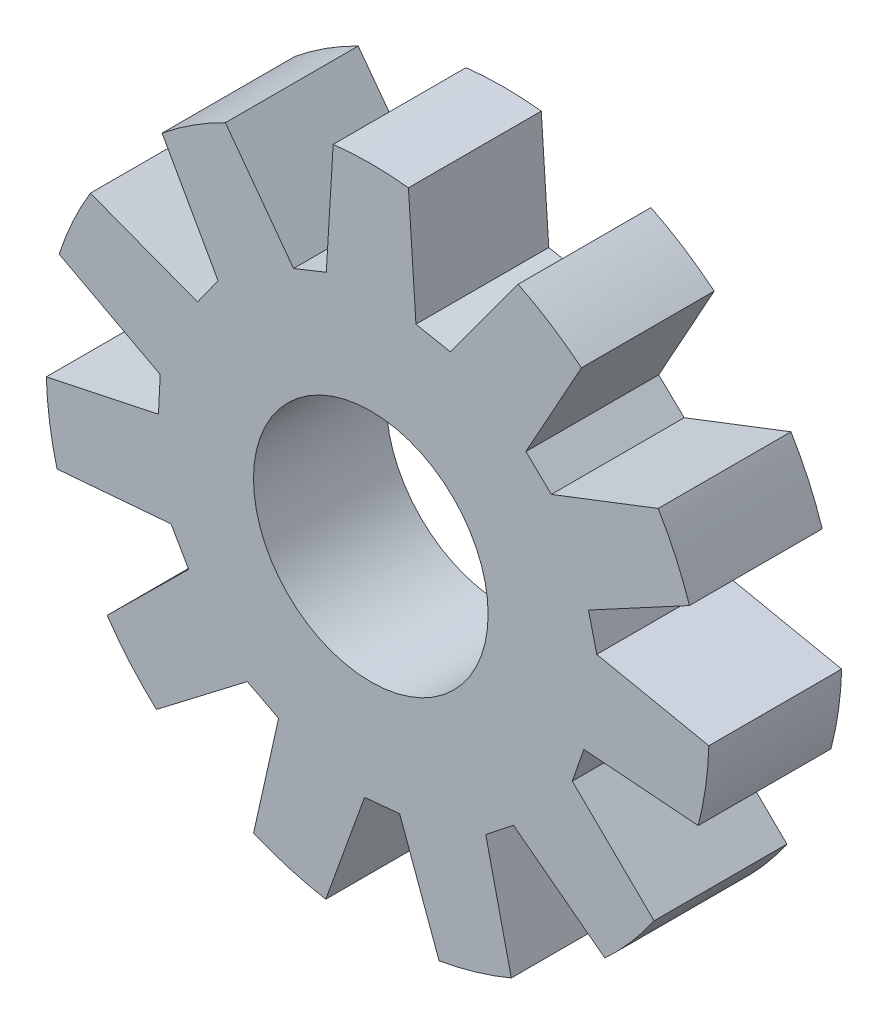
ISO-10303-21;
HEADER;
FILE_DESCRIPTION(('STEP AP214'),'2;1');
FILE_NAME('part.step','',(''),(''),'','','');
FILE_SCHEMA(('AUTOMOTIVE_DESIGN { 1 0 10303 214 1 1 1 1 }'));
ENDSEC;
DATA;
#1=APPLICATION_CONTEXT('core data for automotive mechanical design processes');
#2=APPLICATION_PROTOCOL_DEFINITION('international standard','automotive_design',2000,#1);
#3=PRODUCT_CONTEXT('',#1,'mechanical');
#4=PRODUCT('Part','Part','',(#3));
#5=PRODUCT_RELATED_PRODUCT_CATEGORY('part','',(#4));
#6=PRODUCT_DEFINITION_FORMATION('','',#4);
#7=PRODUCT_DEFINITION_CONTEXT('part definition',#1,'design');
#8=PRODUCT_DEFINITION('design','',#6,#7);
#9=PRODUCT_DEFINITION_SHAPE('','',#8);
#10=(LENGTH_UNIT() NAMED_UNIT(*) SI_UNIT(.MILLI.,.METRE.));
#11=(NAMED_UNIT(*) PLANE_ANGLE_UNIT() SI_UNIT($,.RADIAN.));
#12=(NAMED_UNIT(*) SI_UNIT($,.STERADIAN.) SOLID_ANGLE_UNIT());
#13=UNCERTAINTY_MEASURE_WITH_UNIT(LENGTH_MEASURE(1.E-05),#10,'distance_accuracy_value','');
#14=(GEOMETRIC_REPRESENTATION_CONTEXT(3) GLOBAL_UNCERTAINTY_ASSIGNED_CONTEXT((#13)) GLOBAL_UNIT_ASSIGNED_CONTEXT((#10,
#11,#12)) REPRESENTATION_CONTEXT('',''));
#15=CARTESIAN_POINT('',(0.,0.,0.));
#16=DIRECTION('',(0.,0.,1.));
#17=DIRECTION('',(1.,0.,0.));
#18=AXIS2_PLACEMENT_3D('',#15,#16,#17);
#19=CARTESIAN_POINT('',(-0.11451826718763,0.0698376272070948,3.));
#20=DIRECTION('',(0.,0.,1.));
#21=DIRECTION('',(1.,0.,0.));
#22=AXIS2_PLACEMENT_3D('',#19,#20,#21);
#23=PLANE('',#22);
#24=CARTESIAN_POINT('',(-0.11451826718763,0.0698376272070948,3.));
#25=DIRECTION('',(0.,0.,1.));
#26=DIRECTION('',(1.,0.,0.));
#27=AXIS2_PLACEMENT_3D('',#24,#25,#26);
#28=CIRCLE('',#27,7.48813954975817);
#29=CARTESIAN_POINT('',(4.6227744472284,5.86900064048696,3.));
#30=VERTEX_POINT('',#29);
#31=CARTESIAN_POINT('',(3.1926434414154,6.78809003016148,3.));
#32=VERTEX_POINT('',#31);
#33=EDGE_CURVE('E433',#30,#32,#28,.T.);
#34=ORIENTED_EDGE('',*,*,#33,.T.);
#35=DIRECTION('',(-0.590266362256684,-0.807208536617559,0.));
#36=VECTOR('',#35,1.);
#37=CARTESIAN_POINT('',(3.1926434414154,6.78809003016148,3.));
#38=LINE('',#37,#36);
#39=CARTESIAN_POINT('',(1.66692006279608,4.70161345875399,3.));
#40=VERTEX_POINT('',#39);
#41=EDGE_CURVE('E201',#32,#40,#38,.T.);
#42=ORIENTED_EDGE('',*,*,#41,.T.);
#43=DIRECTION('',(-0.981711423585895,0.190375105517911,0.));
#44=VECTOR('',#43,1.);
#45=CARTESIAN_POINT('',(0.885316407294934,4.85318333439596,3.));
#46=LINE('',#45,#44);
#47=CARTESIAN_POINT('',(0.885316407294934,4.85318333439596,3.));
#48=VERTEX_POINT('',#47);
#49=EDGE_CURVE('E556',#40,#48,#46,.T.);
#50=ORIENTED_EDGE('',*,*,#49,.T.);
#51=DIRECTION('',(-0.0654368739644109,0.99785671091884,0.));
#52=VECTOR('',#51,1.);
#53=CARTESIAN_POINT('',(0.715904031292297,7.43657807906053,3.));
#54=LINE('',#53,#52);
#55=CARTESIAN_POINT('',(0.715904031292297,7.43657807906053,3.));
#56=VERTEX_POINT('',#55);
#57=EDGE_CURVE('E575',#48,#56,#54,.T.);
#58=ORIENTED_EDGE('',*,*,#57,.T.);
#59=CARTESIAN_POINT('',(-0.134095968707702,-0.00316209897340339,3.));
#60=DIRECTION('',(0.,0.,1.));
#61=DIRECTION('',(1.,0.,0.));
#62=AXIS2_PLACEMENT_3D('',#59,#60,#61);
#63=CIRCLE('',#62,7.48813954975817);
#64=CARTESIAN_POINT('',(-0.984095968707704,7.43657807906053,3.));
#65=VERTEX_POINT('',#64);
#66=EDGE_CURVE('E572',#56,#65,#63,.T.);
#67=ORIENTED_EDGE('',*,*,#66,.T.);
#68=DIRECTION('',(-0.0601537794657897,-0.998189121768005,0.));
#69=VECTOR('',#68,1.);
#70=CARTESIAN_POINT('',(-0.984095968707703,7.43657807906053,3.));
#71=LINE('',#70,#69);
#72=CARTESIAN_POINT('',(-1.13958175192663,4.85645395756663,3.));
#73=VERTEX_POINT('',#72);
#74=EDGE_CURVE('E574',#65,#73,#71,.T.);
#75=ORIENTED_EDGE('',*,*,#74,.T.);
#76=DIRECTION('',(-0.928792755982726,-0.370599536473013,0.));
#77=VECTOR('',#76,1.);
#78=CARTESIAN_POINT('',(-1.87905344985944,4.56139581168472,3.));
#79=LINE('',#78,#77);
#80=CARTESIAN_POINT('',(-1.87905344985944,4.56139581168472,3.));
#81=VERTEX_POINT('',#80);
#82=EDGE_CURVE('E577',#73,#81,#79,.T.);
#83=ORIENTED_EDGE('',*,*,#82,.T.);
#84=DIRECTION('',(-0.594531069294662,0.804072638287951,0.));
#85=VECTOR('',#84,1.);
#86=CARTESIAN_POINT('',(-3.41826085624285,6.64309452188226,3.));
#87=LINE('',#86,#85);
#88=CARTESIAN_POINT('',(-3.41826085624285,6.64309452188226,3.));
#89=VERTEX_POINT('',#88);
#90=EDGE_CURVE('E583',#81,#89,#87,.T.);
#91=ORIENTED_EDGE('',*,*,#90,.T.);
#92=CARTESIAN_POINT('',(-0.111099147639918,-0.0751578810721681,3.));
#93=DIRECTION('',(0.,0.,1.));
#94=DIRECTION('',(1.,0.,0.));
#95=AXIS2_PLACEMENT_3D('',#92,#93,#94);
#96=CIRCLE('',#95,7.48813954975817);
#97=CARTESIAN_POINT('',(-4.84839186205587,5.72400513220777,3.));
#98=VERTEX_POINT('',#97);
#99=EDGE_CURVE('E585',#89,#98,#96,.T.);
#100=ORIENTED_EDGE('',*,*,#99,.T.);
#101=DIRECTION('',(0.489057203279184,-0.872251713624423,0.));
#102=VECTOR('',#101,1.);
#103=CARTESIAN_POINT('',(-4.84839186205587,5.72400513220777,3.));
#104=LINE('',#103,#102);
#105=CARTESIAN_POINT('',(-3.58427441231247,3.46940463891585,3.));
#106=VERTEX_POINT('',#105);
#107=EDGE_CURVE('E587',#98,#106,#104,.T.);
#108=ORIENTED_EDGE('',*,*,#107,.T.);
#109=DIRECTION('',(-0.580988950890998,-0.81391144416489,0.));
#110=VECTOR('',#109,1.);
#111=CARTESIAN_POINT('',(-4.04683711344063,2.82139734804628,3.));
#112=LINE('',#111,#110);
#113=CARTESIAN_POINT('',(-4.04683711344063,2.82139734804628,3.));
#114=VERTEX_POINT('',#113);
#115=EDGE_CURVE('E589',#106,#114,#112,.T.);
#116=ORIENTED_EDGE('',*,*,#115,.T.);
#117=DIRECTION('',(-0.93486585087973,0.35500118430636,0.));
#118=VECTOR('',#117,1.);
#119=CARTESIAN_POINT('',(-6.46715207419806,3.74047539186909,3.));
#120=LINE('',#119,#118);
#121=CARTESIAN_POINT('',(-6.46715207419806,3.74047539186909,3.));
#122=VERTEX_POINT('',#121);
#123=EDGE_CURVE('E591',#114,#122,#120,.T.);
#124=ORIENTED_EDGE('',*,*,#123,.T.);
#125=CARTESIAN_POINT('',(-0.0528291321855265,-0.123291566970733,3.));
#126=DIRECTION('',(0.,0.,1.));
#127=DIRECTION('',(1.,0.,0.));
#128=AXIS2_PLACEMENT_3D('',#125,#126,#127);
#129=CIRCLE('',#128,7.48813954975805);
#130=CARTESIAN_POINT('',(-7.17335759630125,2.1941009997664,3.));
#131=VERTEX_POINT('',#130);
#132=EDGE_CURVE('E593',#122,#131,#129,.T.);
#133=ORIENTED_EDGE('',*,*,#132,.T.);
#134=DIRECTION('',(0.882995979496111,-0.469380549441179,0.));
#135=VECTOR('',#134,1.);
#136=CARTESIAN_POINT('',(-7.17335759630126,2.1941009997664,3.));
#137=LINE('',#136,#135);
#138=CARTESIAN_POINT('',(-4.89098527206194,0.980843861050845,3.));
#139=VERTEX_POINT('',#138);
#140=EDGE_CURVE('E595',#131,#139,#137,.T.);
#141=ORIENTED_EDGE('',*,*,#140,.T.);
#142=DIRECTION('',(-0.0487252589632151,-0.998812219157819,0.));
#143=VECTOR('',#142,1.);
#144=CARTESIAN_POINT('',(-4.92977858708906,0.185625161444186,3.));
#145=LINE('',#144,#143);
#146=CARTESIAN_POINT('',(-4.92977858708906,0.185625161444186,3.));
#147=VERTEX_POINT('',#146);
#148=EDGE_CURVE('E597',#139,#147,#145,.T.);
#149=ORIENTED_EDGE('',*,*,#148,.T.);
#150=DIRECTION('',(-0.978387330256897,-0.206780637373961,0.));
#151=VECTOR('',#150,1.);
#152=CARTESIAN_POINT('',(-7.46276820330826,-0.349718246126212,3.));
#153=LINE('',#152,#151);
#154=CARTESIAN_POINT('',(-7.46276820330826,-0.349718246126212,3.));
#155=VERTEX_POINT('',#154);
#156=EDGE_CURVE('E599',#147,#155,#153,.T.);
#157=ORIENTED_EDGE('',*,*,#156,.T.);
#158=CARTESIAN_POINT('',(0.0222137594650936,-0.132281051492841,3.));
#159=DIRECTION('',(0.,0.,1.));
#160=DIRECTION('',(1.,0.,0.));
#161=AXIS2_PLACEMENT_3D('',#158,#159,#160);
#162=CIRCLE('',#161,7.48813954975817);
#163=CARTESIAN_POINT('',(-7.22083297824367,-2.03241469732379,3.));
#164=VERTEX_POINT('',#163);
#165=EDGE_CURVE('E601',#155,#164,#162,.T.);
#166=ORIENTED_EDGE('',*,*,#165,.T.);
#167=DIRECTION('',(0.996589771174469,0.0825156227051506,0.));
#168=VECTOR('',#167,1.);
#169=CARTESIAN_POINT('',(-7.22083297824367,-2.0324146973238,3.));
#170=LINE('',#169,#168);
#171=CARTESIAN_POINT('',(-4.64484286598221,-1.81912791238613,3.));
#172=VERTEX_POINT('',#171);
#173=EDGE_CURVE('E603',#164,#172,#170,.T.);
#174=ORIENTED_EDGE('',*,*,#173,.T.);
#175=DIRECTION('',(0.499008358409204,-0.866597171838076,0.));
#176=VECTOR('',#175,1.);
#177=CARTESIAN_POINT('',(-4.24755019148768,-2.50908170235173,3.));
#178=LINE('',#177,#176);
#179=CARTESIAN_POINT('',(-4.24755019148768,-2.50908170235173,3.));
#180=VERTEX_POINT('',#179);
#181=EDGE_CURVE('E605',#172,#180,#178,.T.);
#182=ORIENTED_EDGE('',*,*,#181,.T.);
#183=DIRECTION('',(-0.711277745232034,-0.702911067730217,0.));
#184=VECTOR('',#183,1.);
#185=CARTESIAN_POINT('',(-6.08900815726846,-4.3288788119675,3.));
#186=LINE('',#185,#184);
#187=CARTESIAN_POINT('',(-6.08900815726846,-4.3288788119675,3.));
#188=VERTEX_POINT('',#187);
#189=EDGE_CURVE('E607',#180,#188,#186,.T.);
#190=ORIENTED_EDGE('',*,*,#189,.T.);
#191=CARTESIAN_POINT('',(0.0902039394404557,-0.0992722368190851,3.));
#192=DIRECTION('',(0.,0.,1.));
#193=DIRECTION('',(1.,0.,0.));
#194=AXIS2_PLACEMENT_3D('',#191,#192,#193);
#195=CIRCLE('',#194,7.48813954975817);
#196=CARTESIAN_POINT('',(-4.97574490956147,-5.61365308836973,3.));
#197=VERTEX_POINT('',#196);
#198=EDGE_CURVE('E609',#188,#197,#195,.T.);
#199=ORIENTED_EDGE('',*,*,#198,.T.);
#200=DIRECTION('',(0.793773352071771,0.608213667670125,0.));
#201=VECTOR('',#200,1.);
#202=CARTESIAN_POINT('',(-4.97574490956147,-5.61365308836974,3.));
#203=LINE('',#202,#201);
#204=CARTESIAN_POINT('',(-2.9239956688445,-4.04153942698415,3.));
#205=VERTEX_POINT('',#204);
#206=EDGE_CURVE('E611',#197,#205,#203,.T.);
#207=ORIENTED_EDGE('',*,*,#206,.T.);
#208=DIRECTION('',(0.888310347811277,-0.459243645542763,0.));
#209=VECTOR('',#208,1.);
#210=CARTESIAN_POINT('',(-2.21675462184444,-4.40717285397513,3.));
#211=LINE('',#210,#209);
#212=CARTESIAN_POINT('',(-2.21675462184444,-4.40717285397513,3.));
#213=VERTEX_POINT('',#212);
#214=EDGE_CURVE('E613',#205,#213,#211,.T.);
#215=ORIENTED_EDGE('',*,*,#214,.T.);
#216=DIRECTION('',(-0.218342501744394,-0.975872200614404,0.));
#217=VECTOR('',#216,1.);
#218=CARTESIAN_POINT('',(-2.78203104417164,-6.9336509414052,3.));
#219=LINE('',#218,#217);
#220=CARTESIAN_POINT('',(-2.78203104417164,-6.9336509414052,3.));
#221=VERTEX_POINT('',#220);
#222=EDGE_CURVE('E615',#213,#221,#219,.T.);
#223=ORIENTED_EDGE('',*,*,#222,.T.);
#224=CARTESIAN_POINT('',(0.129555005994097,-0.0347451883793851,3.));
#225=DIRECTION('',(0.,0.,1.));
#226=DIRECTION('',(1.,0.,0.));
#227=AXIS2_PLACEMENT_3D('',#224,#225,#226);
#228=CIRCLE('',#227,7.48813954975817);
#229=CARTESIAN_POINT('',(-1.15089298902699,-7.41259628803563,3.));
#230=VERTEX_POINT('',#229);
#231=EDGE_CURVE('E617',#221,#230,#228,.T.);
#232=ORIENTED_EDGE('',*,*,#231,.T.);
#233=DIRECTION('',(0.338939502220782,0.940808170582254,0.));
#234=VECTOR('',#233,1.);
#235=CARTESIAN_POINT('',(-1.15089298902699,-7.41259628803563,3.));
#236=LINE('',#235,#234);
#237=CARTESIAN_POINT('',(-0.274800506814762,-4.98079072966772,3.));
#238=VERTEX_POINT('',#237);
#239=EDGE_CURVE('E619',#230,#238,#236,.T.);
#240=ORIENTED_EDGE('',*,*,#239,.T.);
#241=DIRECTION('',(0.995580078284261,0.0939164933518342,0.));
#242=VECTOR('',#241,1.);
#243=CARTESIAN_POINT('',(0.517844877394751,-4.90601776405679,3.));
#244=LINE('',#243,#242);
#245=CARTESIAN_POINT('',(0.517844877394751,-4.90601776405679,3.));
#246=VERTEX_POINT('',#245);
#247=EDGE_CURVE('E621',#238,#246,#244,.T.);
#248=ORIENTED_EDGE('',*,*,#247,.T.);
#249=DIRECTION('',(0.343914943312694,-0.939000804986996,0.));
#250=VECTOR('',#249,1.);
#251=CARTESIAN_POINT('',(1.40822126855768,-7.33703788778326,3.));
#252=LINE('',#251,#250);
#253=CARTESIAN_POINT('',(1.40822126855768,-7.33703788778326,3.));
#254=VERTEX_POINT('',#253);
#255=EDGE_CURVE('E623',#246,#254,#252,.T.);
#256=ORIENTED_EDGE('',*,*,#255,.T.);
#257=CARTESIAN_POINT('',(0.127773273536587,0.0408132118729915,3.));
#258=DIRECTION('',(0.,0.,1.));
#259=DIRECTION('',(1.,0.,0.));
#260=AXIS2_PLACEMENT_3D('',#257,#258,#259);
#261=CIRCLE('',#260,7.48813954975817);
#262=CARTESIAN_POINT('',(3.03935932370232,-6.85809254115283,3.));
#263=VERTEX_POINT('',#262);
#264=EDGE_CURVE('E625',#254,#263,#261,.T.);
#265=ORIENTED_EDGE('',*,*,#264,.T.);
#266=DIRECTION('',(-0.22350524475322,0.974702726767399,0.));
#267=VECTOR('',#266,1.);
#268=CARTESIAN_POINT('',(3.03935932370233,-6.85809254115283,3.));
#269=LINE('',#268,#267);
#270=CARTESIAN_POINT('',(2.46164187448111,-4.33867616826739,3.));
#271=VERTEX_POINT('',#270);
#272=EDGE_CURVE('E627',#263,#271,#269,.T.);
#273=ORIENTED_EDGE('',*,*,#272,.T.);
#274=DIRECTION('',(0.786760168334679,0.617258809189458,0.));
#275=VECTOR('',#274,1.);
#276=CARTESIAN_POINT('',(3.08803228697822,-3.84723669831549,3.));
#277=LINE('',#276,#275);
#278=CARTESIAN_POINT('',(3.08803228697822,-3.84723669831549,3.));
#279=VERTEX_POINT('',#278);
#280=EDGE_CURVE('E629',#271,#279,#277,.T.);
#281=ORIENTED_EDGE('',*,*,#280,.T.);
#282=DIRECTION('',(0.796981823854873,-0.604003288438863,0.));
#283=VECTOR('',#282,1.);
#284=CARTESIAN_POINT('',(5.15137327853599,-5.41096714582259,3.));
#285=LINE('',#284,#283);
#286=CARTESIAN_POINT('',(5.15137327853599,-5.41096714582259,3.));
#287=VERTEX_POINT('',#286);
#288=EDGE_CURVE('E631',#279,#287,#285,.T.);
#289=ORIENTED_EDGE('',*,*,#288,.T.);
#290=CARTESIAN_POINT('',(0.0854244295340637,0.10341370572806,3.));
#291=DIRECTION('',(0.,0.,1.));
#292=DIRECTION('',(1.,0.,0.));
#293=AXIS2_PLACEMENT_3D('',#290,#291,#292);
#294=CIRCLE('',#293,7.48813954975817);
#295=CARTESIAN_POINT('',(6.26463652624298,-4.12619286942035,3.));
#296=VERTEX_POINT('',#295);
#297=EDGE_CURVE('E633',#287,#296,#294,.T.);
#298=ORIENTED_EDGE('',*,*,#297,.T.);
#299=DIRECTION('',(-0.714988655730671,0.699136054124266,0.));
#300=VECTOR('',#299,1.);
#301=CARTESIAN_POINT('',(6.26463652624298,-4.12619286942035,3.));
#302=LINE('',#301,#300);
#303=CARTESIAN_POINT('',(4.41653035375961,-2.31906257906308,3.));
#304=VERTEX_POINT('',#303);
#305=EDGE_CURVE('E635',#296,#304,#302,.T.);
#306=ORIENTED_EDGE('',*,*,#305,.T.);
#307=DIRECTION('',(0.328149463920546,0.944625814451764,0.));
#308=VECTOR('',#307,1.);
#309=CARTESIAN_POINT('',(4.67779126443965,-1.56698516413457,3.));
#310=LINE('',#309,#308);
#311=CARTESIAN_POINT('',(4.67779126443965,-1.56698516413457,3.));
#312=VERTEX_POINT('',#311);
#313=EDGE_CURVE('E637',#304,#312,#310,.T.);
#314=ORIENTED_EDGE('',*,*,#313,.T.);
#315=DIRECTION('',(0.997012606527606,-0.0772389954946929,0.));
#316=VECTOR('',#315,1.);
#317=CARTESIAN_POINT('',(7.25900067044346,-1.76695256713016,3.));
#318=LINE('',#317,#316);
#319=CARTESIAN_POINT('',(7.25900067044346,-1.76695256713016,3.));
#320=VERTEX_POINT('',#319);
#321=EDGE_CURVE('E639',#312,#320,#318,.T.);
#322=ORIENTED_EDGE('',*,*,#321,.T.);
#323=CARTESIAN_POINT('',(0.0159539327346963,0.13318107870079,3.));
#324=DIRECTION('',(0.,0.,1.));
#325=DIRECTION('',(1.,0.,0.));
#326=AXIS2_PLACEMENT_3D('',#323,#324,#325);
#327=CIRCLE('',#326,7.48813954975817);
#328=CARTESIAN_POINT('',(7.50093589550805,-0.0842561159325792,3.));
#329=VERTEX_POINT('',#328);
#330=EDGE_CURVE('E641',#320,#329,#327,.T.);
#331=ORIENTED_EDGE('',*,*,#330,.T.);
#332=DIRECTION('',(-0.979468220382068,0.201598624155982,0.));
#333=VECTOR('',#332,1.);
#334=CARTESIAN_POINT('',(7.50093589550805,-0.0842561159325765,3.));
#335=LINE('',#334,#333);
#336=CARTESIAN_POINT('',(4.96920165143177,0.436836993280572,3.));
#337=VERTEX_POINT('',#336);
#338=EDGE_CURVE('E643',#329,#337,#335,.T.);
#339=ORIENTED_EDGE('',*,*,#338,.T.);
#340=DIRECTION('',(-0.234646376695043,0.972080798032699,0.));
#341=VECTOR('',#340,1.);
#342=CARTESIAN_POINT('',(4.78238456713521,1.21077308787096,3.));
#343=LINE('',#342,#341);
#344=CARTESIAN_POINT('',(4.78238456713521,1.21077308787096,3.));
#345=VERTEX_POINT('',#344);
#346=EDGE_CURVE('E645',#337,#345,#343,.T.);
#347=ORIENTED_EDGE('',*,*,#346,.T.);
#348=DIRECTION('',(0.880498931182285,0.474048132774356,0.));
#349=VECTOR('',#348,1.);
#350=CARTESIAN_POINT('',(7.0619466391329,2.4380569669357,3.));
#351=LINE('',#350,#349);
#352=CARTESIAN_POINT('',(7.0619466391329,2.4380569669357,3.));
#353=VERTEX_POINT('',#352);
#354=EDGE_CURVE('E647',#345,#353,#351,.T.);
#355=ORIENTED_EDGE('',*,*,#354,.T.);
#356=CARTESIAN_POINT('',(-0.0585818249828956,0.120664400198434,3.));
#357=DIRECTION('',(0.,0.,1.));
#358=DIRECTION('',(1.,0.,0.));
#359=AXIS2_PLACEMENT_3D('',#356,#357,#358);
#360=CIRCLE('',#359,7.48813954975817);
#361=CARTESIAN_POINT('',(6.3557411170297,3.98443135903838,3.));
#362=VERTEX_POINT('',#361);
#363=EDGE_CURVE('E328',#353,#362,#360,.T.);
#364=ORIENTED_EDGE('',*,*,#363,.T.);
#365=DIRECTION('',(-0.932973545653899,-0.359944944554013,0.));
#366=VECTOR('',#365,1.);
#367=CARTESIAN_POINT('',(6.3557411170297,3.98443135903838,3.));
#368=LINE('',#367,#366);
#369=CARTESIAN_POINT('',(3.94418653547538,3.05404390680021,3.));
#370=VERTEX_POINT('',#369);
#371=EDGE_CURVE('E322',#362,#370,#368,.T.);
#372=ORIENTED_EDGE('',*,*,#371,.T.);
#373=DIRECTION('',(-0.722943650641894,0.690906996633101,0.));
#374=VECTOR('',#373,1.);
#375=CARTESIAN_POINT('',(3.36860456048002,3.6041194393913,3.));
#376=LINE('',#375,#374);
#377=CARTESIAN_POINT('',(3.36860456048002,3.6041194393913,3.));
#378=VERTEX_POINT('',#377);
#379=EDGE_CURVE('E326',#370,#378,#376,.T.);
#380=ORIENTED_EDGE('',*,*,#379,.T.);
#381=DIRECTION('',(0.484433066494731,0.874828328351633,0.));
#382=VECTOR('',#381,1.);
#383=CARTESIAN_POINT('',(4.6227744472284,5.86900064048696,3.));
#384=LINE('',#383,#382);
#385=EDGE_CURVE('E50',#378,#30,#384,.T.);
#386=ORIENTED_EDGE('',*,*,#385,.T.);
#387=EDGE_LOOP('',(#34,#42,#50,#58,#67,#75,#83,#91,#100,#108,#116,#124,#133,#141,#149,#157,#166,
#174,#182,#190,#199,#207,#215,#223,#232,#240,#248,#256,#265,#273,#281,#289,#298,#306,#314,#322,
#331,#339,#347,#355,#364,#372,#380,#386));
#388=FACE_BOUND('',#387,.T.);
#389=CARTESIAN_POINT('',(-0.134095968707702,-0.00316209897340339,3.));
#390=DIRECTION('',(0.,0.,1.));
#391=DIRECTION('',(1.,0.,0.));
#392=AXIS2_PLACEMENT_3D('',#389,#390,#391);
#393=CIRCLE('',#392,2.65);
#394=CARTESIAN_POINT('',(2.5159040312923,-0.00316209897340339,3.));
#395=VERTEX_POINT('',#394);
#396=EDGE_CURVE('E350',#395,#395,#393,.T.);
#397=ORIENTED_EDGE('',*,*,#396,.F.);
#398=EDGE_LOOP('',(#397));
#399=FACE_BOUND('',#398,.T.);
#400=ADVANCED_FACE('F33',(#388,#399),#23,.T.);
#401=CARTESIAN_POINT('',(-0.11451826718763,0.0698376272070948,0.));
#402=DIRECTION('',(0.,0.,1.));
#403=DIRECTION('',(1.,0.,0.));
#404=AXIS2_PLACEMENT_3D('',#401,#402,#403);
#405=PLANE('',#404);
#406=CARTESIAN_POINT('',(-0.11451826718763,0.0698376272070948,0.));
#407=DIRECTION('',(0.,0.,1.));
#408=DIRECTION('',(1.,0.,0.));
#409=AXIS2_PLACEMENT_3D('',#406,#407,#408);
#410=CIRCLE('',#409,7.48813954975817);
#411=CARTESIAN_POINT('',(4.6227744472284,5.86900064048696,0.));
#412=VERTEX_POINT('',#411);
#413=CARTESIAN_POINT('',(3.1926434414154,6.78809003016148,0.));
#414=VERTEX_POINT('',#413);
#415=EDGE_CURVE('E346',#412,#414,#410,.T.);
#416=ORIENTED_EDGE('',*,*,#415,.F.);
#417=DIRECTION('',(0.484433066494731,0.874828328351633,0.));
#418=VECTOR('',#417,1.);
#419=CARTESIAN_POINT('',(4.6227744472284,5.86900064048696,0.));
#420=LINE('',#419,#418);
#421=CARTESIAN_POINT('',(3.36860456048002,3.6041194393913,0.));
#422=VERTEX_POINT('',#421);
#423=EDGE_CURVE('E193',#422,#412,#420,.T.);
#424=ORIENTED_EDGE('',*,*,#423,.F.);
#425=DIRECTION('',(-0.722943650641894,0.690906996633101,0.));
#426=VECTOR('',#425,1.);
#427=CARTESIAN_POINT('',(3.36860456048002,3.6041194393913,0.));
#428=LINE('',#427,#426);
#429=CARTESIAN_POINT('',(3.94418653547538,3.05404390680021,0.));
#430=VERTEX_POINT('',#429);
#431=EDGE_CURVE('E187',#430,#422,#428,.T.);
#432=ORIENTED_EDGE('',*,*,#431,.F.);
#433=DIRECTION('',(-0.932973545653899,-0.359944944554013,0.));
#434=VECTOR('',#433,1.);
#435=CARTESIAN_POINT('',(6.3557411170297,3.98443135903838,0.));
#436=LINE('',#435,#434);
#437=CARTESIAN_POINT('',(6.3557411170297,3.98443135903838,0.));
#438=VERTEX_POINT('',#437);
#439=EDGE_CURVE('E336',#438,#430,#436,.T.);
#440=ORIENTED_EDGE('',*,*,#439,.F.);
#441=CARTESIAN_POINT('',(-0.0585818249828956,0.120664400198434,0.));
#442=DIRECTION('',(0.,0.,1.));
#443=DIRECTION('',(1.,0.,0.));
#444=AXIS2_PLACEMENT_3D('',#441,#442,#443);
#445=CIRCLE('',#444,7.48813954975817);
#446=CARTESIAN_POINT('',(7.0619466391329,2.4380569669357,0.));
#447=VERTEX_POINT('',#446);
#448=EDGE_CURVE('E428',#447,#438,#445,.T.);
#449=ORIENTED_EDGE('',*,*,#448,.F.);
#450=DIRECTION('',(0.880498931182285,0.474048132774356,0.));
#451=VECTOR('',#450,1.);
#452=CARTESIAN_POINT('',(7.0619466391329,2.4380569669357,0.));
#453=LINE('',#452,#451);
#454=CARTESIAN_POINT('',(4.78238456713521,1.21077308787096,0.));
#455=VERTEX_POINT('',#454);
#456=EDGE_CURVE('E426',#455,#447,#453,.T.);
#457=ORIENTED_EDGE('',*,*,#456,.F.);
#458=DIRECTION('',(-0.234646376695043,0.972080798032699,0.));
#459=VECTOR('',#458,1.);
#460=CARTESIAN_POINT('',(4.78238456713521,1.21077308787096,0.));
#461=LINE('',#460,#459);
#462=CARTESIAN_POINT('',(4.96920165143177,0.436836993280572,0.));
#463=VERTEX_POINT('',#462);
#464=EDGE_CURVE('E424',#463,#455,#461,.T.);
#465=ORIENTED_EDGE('',*,*,#464,.F.);
#466=DIRECTION('',(-0.979468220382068,0.201598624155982,0.));
#467=VECTOR('',#466,1.);
#468=CARTESIAN_POINT('',(7.50093589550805,-0.0842561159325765,0.));
#469=LINE('',#468,#467);
#470=CARTESIAN_POINT('',(7.50093589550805,-0.0842561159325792,0.));
#471=VERTEX_POINT('',#470);
#472=EDGE_CURVE('E422',#471,#463,#469,.T.);
#473=ORIENTED_EDGE('',*,*,#472,.F.);
#474=CARTESIAN_POINT('',(0.0159539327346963,0.13318107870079,0.));
#475=DIRECTION('',(0.,0.,1.));
#476=DIRECTION('',(1.,0.,0.));
#477=AXIS2_PLACEMENT_3D('',#474,#475,#476);
#478=CIRCLE('',#477,7.48813954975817);
#479=CARTESIAN_POINT('',(7.25900067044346,-1.76695256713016,0.));
#480=VERTEX_POINT('',#479);
#481=EDGE_CURVE('E420',#480,#471,#478,.T.);
#482=ORIENTED_EDGE('',*,*,#481,.F.);
#483=DIRECTION('',(0.997012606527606,-0.0772389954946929,0.));
#484=VECTOR('',#483,1.);
#485=CARTESIAN_POINT('',(7.25900067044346,-1.76695256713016,0.));
#486=LINE('',#485,#484);
#487=CARTESIAN_POINT('',(4.67779126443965,-1.56698516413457,0.));
#488=VERTEX_POINT('',#487);
#489=EDGE_CURVE('E418',#488,#480,#486,.T.);
#490=ORIENTED_EDGE('',*,*,#489,.F.);
#491=DIRECTION('',(0.328149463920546,0.944625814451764,0.));
#492=VECTOR('',#491,1.);
#493=CARTESIAN_POINT('',(4.67779126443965,-1.56698516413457,0.));
#494=LINE('',#493,#492);
#495=CARTESIAN_POINT('',(4.41653035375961,-2.31906257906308,0.));
#496=VERTEX_POINT('',#495);
#497=EDGE_CURVE('E416',#496,#488,#494,.T.);
#498=ORIENTED_EDGE('',*,*,#497,.F.);
#499=DIRECTION('',(-0.714988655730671,0.699136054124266,0.));
#500=VECTOR('',#499,1.);
#501=CARTESIAN_POINT('',(6.26463652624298,-4.12619286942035,0.));
#502=LINE('',#501,#500);
#503=CARTESIAN_POINT('',(6.26463652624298,-4.12619286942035,0.));
#504=VERTEX_POINT('',#503);
#505=EDGE_CURVE('E414',#504,#496,#502,.T.);
#506=ORIENTED_EDGE('',*,*,#505,.F.);
#507=CARTESIAN_POINT('',(0.0854244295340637,0.10341370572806,0.));
#508=DIRECTION('',(0.,0.,1.));
#509=DIRECTION('',(1.,0.,0.));
#510=AXIS2_PLACEMENT_3D('',#507,#508,#509);
#511=CIRCLE('',#510,7.48813954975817);
#512=CARTESIAN_POINT('',(5.15137327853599,-5.41096714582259,0.));
#513=VERTEX_POINT('',#512);
#514=EDGE_CURVE('E412',#513,#504,#511,.T.);
#515=ORIENTED_EDGE('',*,*,#514,.F.);
#516=DIRECTION('',(0.796981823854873,-0.604003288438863,0.));
#517=VECTOR('',#516,1.);
#518=CARTESIAN_POINT('',(5.15137327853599,-5.41096714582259,0.));
#519=LINE('',#518,#517);
#520=CARTESIAN_POINT('',(3.08803228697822,-3.84723669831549,0.));
#521=VERTEX_POINT('',#520);
#522=EDGE_CURVE('E410',#521,#513,#519,.T.);
#523=ORIENTED_EDGE('',*,*,#522,.F.);
#524=DIRECTION('',(0.786760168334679,0.617258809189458,0.));
#525=VECTOR('',#524,1.);
#526=CARTESIAN_POINT('',(3.08803228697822,-3.84723669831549,0.));
#527=LINE('',#526,#525);
#528=CARTESIAN_POINT('',(2.46164187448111,-4.33867616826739,0.));
#529=VERTEX_POINT('',#528);
#530=EDGE_CURVE('E408',#529,#521,#527,.T.);
#531=ORIENTED_EDGE('',*,*,#530,.F.);
#532=DIRECTION('',(-0.22350524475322,0.974702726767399,0.));
#533=VECTOR('',#532,1.);
#534=CARTESIAN_POINT('',(3.03935932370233,-6.85809254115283,0.));
#535=LINE('',#534,#533);
#536=CARTESIAN_POINT('',(3.03935932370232,-6.85809254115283,0.));
#537=VERTEX_POINT('',#536);
#538=EDGE_CURVE('E406',#537,#529,#535,.T.);
#539=ORIENTED_EDGE('',*,*,#538,.F.);
#540=CARTESIAN_POINT('',(0.127773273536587,0.0408132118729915,0.));
#541=DIRECTION('',(0.,0.,1.));
#542=DIRECTION('',(1.,0.,0.));
#543=AXIS2_PLACEMENT_3D('',#540,#541,#542);
#544=CIRCLE('',#543,7.48813954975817);
#545=CARTESIAN_POINT('',(1.40822126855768,-7.33703788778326,0.));
#546=VERTEX_POINT('',#545);
#547=EDGE_CURVE('E404',#546,#537,#544,.T.);
#548=ORIENTED_EDGE('',*,*,#547,.F.);
#549=DIRECTION('',(0.343914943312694,-0.939000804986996,0.));
#550=VECTOR('',#549,1.);
#551=CARTESIAN_POINT('',(1.40822126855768,-7.33703788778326,0.));
#552=LINE('',#551,#550);
#553=CARTESIAN_POINT('',(0.517844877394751,-4.90601776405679,0.));
#554=VERTEX_POINT('',#553);
#555=EDGE_CURVE('E402',#554,#546,#552,.T.);
#556=ORIENTED_EDGE('',*,*,#555,.F.);
#557=DIRECTION('',(0.995580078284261,0.0939164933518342,0.));
#558=VECTOR('',#557,1.);
#559=CARTESIAN_POINT('',(0.517844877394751,-4.90601776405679,0.));
#560=LINE('',#559,#558);
#561=CARTESIAN_POINT('',(-0.274800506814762,-4.98079072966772,0.));
#562=VERTEX_POINT('',#561);
#563=EDGE_CURVE('E400',#562,#554,#560,.T.);
#564=ORIENTED_EDGE('',*,*,#563,.F.);
#565=DIRECTION('',(0.338939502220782,0.940808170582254,0.));
#566=VECTOR('',#565,1.);
#567=CARTESIAN_POINT('',(-1.15089298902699,-7.41259628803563,0.));
#568=LINE('',#567,#566);
#569=CARTESIAN_POINT('',(-1.15089298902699,-7.41259628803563,0.));
#570=VERTEX_POINT('',#569);
#571=EDGE_CURVE('E398',#570,#562,#568,.T.);
#572=ORIENTED_EDGE('',*,*,#571,.F.);
#573=CARTESIAN_POINT('',(0.129555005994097,-0.0347451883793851,0.));
#574=DIRECTION('',(0.,0.,1.));
#575=DIRECTION('',(1.,0.,0.));
#576=AXIS2_PLACEMENT_3D('',#573,#574,#575);
#577=CIRCLE('',#576,7.48813954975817);
#578=CARTESIAN_POINT('',(-2.78203104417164,-6.9336509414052,0.));
#579=VERTEX_POINT('',#578);
#580=EDGE_CURVE('E396',#579,#570,#577,.T.);
#581=ORIENTED_EDGE('',*,*,#580,.F.);
#582=DIRECTION('',(-0.218342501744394,-0.975872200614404,0.));
#583=VECTOR('',#582,1.);
#584=CARTESIAN_POINT('',(-2.78203104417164,-6.9336509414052,0.));
#585=LINE('',#584,#583);
#586=CARTESIAN_POINT('',(-2.21675462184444,-4.40717285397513,0.));
#587=VERTEX_POINT('',#586);
#588=EDGE_CURVE('E394',#587,#579,#585,.T.);
#589=ORIENTED_EDGE('',*,*,#588,.F.);
#590=DIRECTION('',(0.888310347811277,-0.459243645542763,0.));
#591=VECTOR('',#590,1.);
#592=CARTESIAN_POINT('',(-2.21675462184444,-4.40717285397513,0.));
#593=LINE('',#592,#591);
#594=CARTESIAN_POINT('',(-2.9239956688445,-4.04153942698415,0.));
#595=VERTEX_POINT('',#594);
#596=EDGE_CURVE('E392',#595,#587,#593,.T.);
#597=ORIENTED_EDGE('',*,*,#596,.F.);
#598=DIRECTION('',(0.793773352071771,0.608213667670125,0.));
#599=VECTOR('',#598,1.);
#600=CARTESIAN_POINT('',(-4.97574490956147,-5.61365308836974,0.));
#601=LINE('',#600,#599);
#602=CARTESIAN_POINT('',(-4.97574490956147,-5.61365308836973,0.));
#603=VERTEX_POINT('',#602);
#604=EDGE_CURVE('E390',#603,#595,#601,.T.);
#605=ORIENTED_EDGE('',*,*,#604,.F.);
#606=CARTESIAN_POINT('',(0.0902039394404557,-0.0992722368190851,0.));
#607=DIRECTION('',(0.,0.,1.));
#608=DIRECTION('',(1.,0.,0.));
#609=AXIS2_PLACEMENT_3D('',#606,#607,#608);
#610=CIRCLE('',#609,7.48813954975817);
#611=CARTESIAN_POINT('',(-6.08900815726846,-4.3288788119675,0.));
#612=VERTEX_POINT('',#611);
#613=EDGE_CURVE('E388',#612,#603,#610,.T.);
#614=ORIENTED_EDGE('',*,*,#613,.F.);
#615=DIRECTION('',(-0.711277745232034,-0.702911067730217,0.));
#616=VECTOR('',#615,1.);
#617=CARTESIAN_POINT('',(-6.08900815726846,-4.3288788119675,0.));
#618=LINE('',#617,#616);
#619=CARTESIAN_POINT('',(-4.24755019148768,-2.50908170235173,0.));
#620=VERTEX_POINT('',#619);
#621=EDGE_CURVE('E386',#620,#612,#618,.T.);
#622=ORIENTED_EDGE('',*,*,#621,.F.);
#623=DIRECTION('',(0.499008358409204,-0.866597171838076,0.));
#624=VECTOR('',#623,1.);
#625=CARTESIAN_POINT('',(-4.24755019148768,-2.50908170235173,0.));
#626=LINE('',#625,#624);
#627=CARTESIAN_POINT('',(-4.64484286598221,-1.81912791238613,0.));
#628=VERTEX_POINT('',#627);
#629=EDGE_CURVE('E384',#628,#620,#626,.T.);
#630=ORIENTED_EDGE('',*,*,#629,.F.);
#631=DIRECTION('',(0.996589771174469,0.0825156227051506,0.));
#632=VECTOR('',#631,1.);
#633=CARTESIAN_POINT('',(-7.22083297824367,-2.0324146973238,0.));
#634=LINE('',#633,#632);
#635=CARTESIAN_POINT('',(-7.22083297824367,-2.03241469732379,0.));
#636=VERTEX_POINT('',#635);
#637=EDGE_CURVE('E382',#636,#628,#634,.T.);
#638=ORIENTED_EDGE('',*,*,#637,.F.);
#639=CARTESIAN_POINT('',(0.0222137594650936,-0.132281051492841,0.));
#640=DIRECTION('',(0.,0.,1.));
#641=DIRECTION('',(1.,0.,0.));
#642=AXIS2_PLACEMENT_3D('',#639,#640,#641);
#643=CIRCLE('',#642,7.48813954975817);
#644=CARTESIAN_POINT('',(-7.46276820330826,-0.349718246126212,0.));
#645=VERTEX_POINT('',#644);
#646=EDGE_CURVE('E380',#645,#636,#643,.T.);
#647=ORIENTED_EDGE('',*,*,#646,.F.);
#648=DIRECTION('',(-0.978387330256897,-0.206780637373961,0.));
#649=VECTOR('',#648,1.);
#650=CARTESIAN_POINT('',(-7.46276820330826,-0.349718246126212,0.));
#651=LINE('',#650,#649);
#652=CARTESIAN_POINT('',(-4.92977858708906,0.185625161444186,0.));
#653=VERTEX_POINT('',#652);
#654=EDGE_CURVE('E378',#653,#645,#651,.T.);
#655=ORIENTED_EDGE('',*,*,#654,.F.);
#656=DIRECTION('',(-0.0487252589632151,-0.998812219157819,0.));
#657=VECTOR('',#656,1.);
#658=CARTESIAN_POINT('',(-4.92977858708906,0.185625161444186,0.));
#659=LINE('',#658,#657);
#660=CARTESIAN_POINT('',(-4.89098527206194,0.980843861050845,0.));
#661=VERTEX_POINT('',#660);
#662=EDGE_CURVE('E376',#661,#653,#659,.T.);
#663=ORIENTED_EDGE('',*,*,#662,.F.);
#664=DIRECTION('',(0.882995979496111,-0.469380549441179,0.));
#665=VECTOR('',#664,1.);
#666=CARTESIAN_POINT('',(-7.17335759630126,2.1941009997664,0.));
#667=LINE('',#666,#665);
#668=CARTESIAN_POINT('',(-7.17335759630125,2.1941009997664,0.));
#669=VERTEX_POINT('',#668);
#670=EDGE_CURVE('E374',#669,#661,#667,.T.);
#671=ORIENTED_EDGE('',*,*,#670,.F.);
#672=CARTESIAN_POINT('',(-0.0528291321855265,-0.123291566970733,0.));
#673=DIRECTION('',(0.,0.,1.));
#674=DIRECTION('',(1.,0.,0.));
#675=AXIS2_PLACEMENT_3D('',#672,#673,#674);
#676=CIRCLE('',#675,7.48813954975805);
#677=CARTESIAN_POINT('',(-6.46715207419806,3.74047539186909,0.));
#678=VERTEX_POINT('',#677);
#679=EDGE_CURVE('E372',#678,#669,#676,.T.);
#680=ORIENTED_EDGE('',*,*,#679,.F.);
#681=DIRECTION('',(-0.93486585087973,0.35500118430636,0.));
#682=VECTOR('',#681,1.);
#683=CARTESIAN_POINT('',(-6.46715207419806,3.74047539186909,0.));
#684=LINE('',#683,#682);
#685=CARTESIAN_POINT('',(-4.04683711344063,2.82139734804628,0.));
#686=VERTEX_POINT('',#685);
#687=EDGE_CURVE('E370',#686,#678,#684,.T.);
#688=ORIENTED_EDGE('',*,*,#687,.F.);
#689=DIRECTION('',(-0.580988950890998,-0.81391144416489,0.));
#690=VECTOR('',#689,1.);
#691=CARTESIAN_POINT('',(-4.04683711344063,2.82139734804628,0.));
#692=LINE('',#691,#690);
#693=CARTESIAN_POINT('',(-3.58427441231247,3.46940463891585,0.));
#694=VERTEX_POINT('',#693);
#695=EDGE_CURVE('E368',#694,#686,#692,.T.);
#696=ORIENTED_EDGE('',*,*,#695,.F.);
#697=DIRECTION('',(0.489057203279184,-0.872251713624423,0.));
#698=VECTOR('',#697,1.);
#699=CARTESIAN_POINT('',(-4.84839186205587,5.72400513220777,0.));
#700=LINE('',#699,#698);
#701=CARTESIAN_POINT('',(-4.84839186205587,5.72400513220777,0.));
#702=VERTEX_POINT('',#701);
#703=EDGE_CURVE('E366',#702,#694,#700,.T.);
#704=ORIENTED_EDGE('',*,*,#703,.F.);
#705=CARTESIAN_POINT('',(-0.111099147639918,-0.0751578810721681,0.));
#706=DIRECTION('',(0.,0.,1.));
#707=DIRECTION('',(1.,0.,0.));
#708=AXIS2_PLACEMENT_3D('',#705,#706,#707);
#709=CIRCLE('',#708,7.48813954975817);
#710=CARTESIAN_POINT('',(-3.41826085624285,6.64309452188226,0.));
#711=VERTEX_POINT('',#710);
#712=EDGE_CURVE('E364',#711,#702,#709,.T.);
#713=ORIENTED_EDGE('',*,*,#712,.F.);
#714=DIRECTION('',(-0.594531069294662,0.804072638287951,0.));
#715=VECTOR('',#714,1.);
#716=CARTESIAN_POINT('',(-3.41826085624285,6.64309452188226,0.));
#717=LINE('',#716,#715);
#718=CARTESIAN_POINT('',(-1.87905344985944,4.56139581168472,0.));
#719=VERTEX_POINT('',#718);
#720=EDGE_CURVE('E362',#719,#711,#717,.T.);
#721=ORIENTED_EDGE('',*,*,#720,.F.);
#722=DIRECTION('',(-0.928792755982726,-0.370599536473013,0.));
#723=VECTOR('',#722,1.);
#724=CARTESIAN_POINT('',(-1.87905344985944,4.56139581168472,0.));
#725=LINE('',#724,#723);
#726=CARTESIAN_POINT('',(-1.13958175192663,4.85645395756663,0.));
#727=VERTEX_POINT('',#726);
#728=EDGE_CURVE('E360',#727,#719,#725,.T.);
#729=ORIENTED_EDGE('',*,*,#728,.F.);
#730=DIRECTION('',(-0.0601537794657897,-0.998189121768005,0.));
#731=VECTOR('',#730,1.);
#732=CARTESIAN_POINT('',(-0.984095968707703,7.43657807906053,0.));
#733=LINE('',#732,#731);
#734=CARTESIAN_POINT('',(-0.984095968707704,7.43657807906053,0.));
#735=VERTEX_POINT('',#734);
#736=EDGE_CURVE('E358',#735,#727,#733,.T.);
#737=ORIENTED_EDGE('',*,*,#736,.F.);
#738=CARTESIAN_POINT('',(-0.134095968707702,-0.00316209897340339,0.));
#739=DIRECTION('',(0.,0.,1.));
#740=DIRECTION('',(1.,0.,0.));
#741=AXIS2_PLACEMENT_3D('',#738,#739,#740);
#742=CIRCLE('',#741,7.48813954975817);
#743=CARTESIAN_POINT('',(0.715904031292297,7.43657807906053,0.));
#744=VERTEX_POINT('',#743);
#745=EDGE_CURVE('E356',#744,#735,#742,.T.);
#746=ORIENTED_EDGE('',*,*,#745,.F.);
#747=DIRECTION('',(-0.0654368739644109,0.99785671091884,0.));
#748=VECTOR('',#747,1.);
#749=CARTESIAN_POINT('',(0.715904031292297,7.43657807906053,0.));
#750=LINE('',#749,#748);
#751=CARTESIAN_POINT('',(0.885316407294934,4.85318333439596,0.));
#752=VERTEX_POINT('',#751);
#753=EDGE_CURVE('E354',#752,#744,#750,.T.);
#754=ORIENTED_EDGE('',*,*,#753,.F.);
#755=DIRECTION('',(-0.981711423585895,0.190375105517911,0.));
#756=VECTOR('',#755,1.);
#757=CARTESIAN_POINT('',(0.885316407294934,4.85318333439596,0.));
#758=LINE('',#757,#756);
#759=CARTESIAN_POINT('',(1.66692006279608,4.70161345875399,0.));
#760=VERTEX_POINT('',#759);
#761=EDGE_CURVE('E352',#760,#752,#758,.T.);
#762=ORIENTED_EDGE('',*,*,#761,.F.);
#763=DIRECTION('',(-0.590266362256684,-0.807208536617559,0.));
#764=VECTOR('',#763,1.);
#765=CARTESIAN_POINT('',(3.1926434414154,6.78809003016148,0.));
#766=LINE('',#765,#764);
#767=EDGE_CURVE('E349',#414,#760,#766,.T.);
#768=ORIENTED_EDGE('',*,*,#767,.F.);
#769=EDGE_LOOP('',(#416,#424,#432,#440,#449,#457,#465,#473,#482,#490,#498,#506,#515,#523,#531,
#539,#548,#556,#564,#572,#581,#589,#597,#605,#614,#622,#630,#638,#647,#655,#663,#671,#680,#688,
#696,#704,#713,#721,#729,#737,#746,#754,#762,#768));
#770=FACE_BOUND('',#769,.T.);
#771=CARTESIAN_POINT('',(-0.134095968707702,-0.00316209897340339,0.));
#772=DIRECTION('',(0.,0.,1.));
#773=DIRECTION('',(1.,0.,0.));
#774=AXIS2_PLACEMENT_3D('',#771,#772,#773);
#775=CIRCLE('',#774,2.65);
#776=CARTESIAN_POINT('',(2.5159040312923,-0.00316209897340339,0.));
#777=VERTEX_POINT('',#776);
#778=EDGE_CURVE('E1252',#777,#777,#775,.T.);
#779=ORIENTED_EDGE('',*,*,#778,.T.);
#780=EDGE_LOOP('',(#779));
#781=FACE_BOUND('',#780,.T.);
#782=ADVANCED_FACE('F560',(#770,#781),#405,.F.);
#783=CARTESIAN_POINT('',(-0.11451826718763,0.0698376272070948,3.));
#784=DIRECTION('',(0.,0.,-1.));
#785=DIRECTION('',(-1.,0.,0.));
#786=AXIS2_PLACEMENT_3D('',#783,#784,#785);
#787=CYLINDRICAL_SURFACE('',#786,7.48813954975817);
#788=ORIENTED_EDGE('',*,*,#415,.T.);
#789=DIRECTION('',(0.,0.,-1.));
#790=VECTOR('',#789,1.);
#791=CARTESIAN_POINT('',(3.1926434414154,6.78809003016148,3.));
#792=LINE('',#791,#790);
#793=EDGE_CURVE('E11',#32,#414,#792,.T.);
#794=ORIENTED_EDGE('',*,*,#793,.F.);
#795=ORIENTED_EDGE('',*,*,#33,.F.);
#796=DIRECTION('',(0.,0.,-1.));
#797=VECTOR('',#796,1.);
#798=CARTESIAN_POINT('',(4.6227744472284,5.86900064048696,3.));
#799=LINE('',#798,#797);
#800=EDGE_CURVE('E342',#30,#412,#799,.T.);
#801=ORIENTED_EDGE('',*,*,#800,.T.);
#802=EDGE_LOOP('',(#788,#794,#795,#801));
#803=FACE_BOUND('',#802,.T.);
#804=ADVANCED_FACE('F35',(#803),#787,.T.);
#805=CARTESIAN_POINT('',(3.1926434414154,6.78809003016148,3.));
#806=DIRECTION('',(0.807208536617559,-0.590266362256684,0.));
#807=DIRECTION('',(0.590266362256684,0.807208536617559,0.));
#808=AXIS2_PLACEMENT_3D('',#805,#806,#807);
#809=PLANE('',#808);
#810=ORIENTED_EDGE('',*,*,#767,.T.);
#811=DIRECTION('',(0.,0.,-1.));
#812=VECTOR('',#811,1.);
#813=CARTESIAN_POINT('',(1.66692006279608,4.70161345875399,3.));
#814=LINE('',#813,#812);
#815=EDGE_CURVE('E42',#40,#760,#814,.T.);
#816=ORIENTED_EDGE('',*,*,#815,.F.);
#817=ORIENTED_EDGE('',*,*,#41,.F.);
#818=ORIENTED_EDGE('',*,*,#793,.T.);
#819=EDGE_LOOP('',(#810,#816,#817,#818));
#820=FACE_BOUND('',#819,.T.);
#821=ADVANCED_FACE('F681',(#820),#809,.F.);
#822=CARTESIAN_POINT('',(0.885316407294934,4.85318333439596,3.));
#823=DIRECTION('',(-0.190375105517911,-0.981711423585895,0.));
#824=DIRECTION('',(0.981711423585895,-0.190375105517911,0.));
#825=AXIS2_PLACEMENT_3D('',#822,#823,#824);
#826=PLANE('',#825);
#827=ORIENTED_EDGE('',*,*,#761,.T.);
#828=DIRECTION('',(0.,0.,-1.));
#829=VECTOR('',#828,1.);
#830=CARTESIAN_POINT('',(0.885316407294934,4.85318333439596,3.));
#831=LINE('',#830,#829);
#832=EDGE_CURVE('E548',#48,#752,#831,.T.);
#833=ORIENTED_EDGE('',*,*,#832,.F.);
#834=ORIENTED_EDGE('',*,*,#49,.F.);
#835=ORIENTED_EDGE('',*,*,#815,.T.);
#836=EDGE_LOOP('',(#827,#833,#834,#835));
#837=FACE_BOUND('',#836,.T.);
#838=ADVANCED_FACE('F554',(#837),#826,.F.);
#839=CARTESIAN_POINT('',(0.715904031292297,7.43657807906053,3.));
#840=DIRECTION('',(-0.99785671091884,-0.0654368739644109,0.));
#841=DIRECTION('',(0.0654368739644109,-0.99785671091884,0.));
#842=AXIS2_PLACEMENT_3D('',#839,#840,#841);
#843=PLANE('',#842);
#844=ORIENTED_EDGE('',*,*,#753,.T.);
#845=DIRECTION('',(0.,0.,-1.));
#846=VECTOR('',#845,1.);
#847=CARTESIAN_POINT('',(0.715904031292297,7.43657807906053,3.));
#848=LINE('',#847,#846);
#849=EDGE_CURVE('E545',#56,#744,#848,.T.);
#850=ORIENTED_EDGE('',*,*,#849,.F.);
#851=ORIENTED_EDGE('',*,*,#57,.F.);
#852=ORIENTED_EDGE('',*,*,#832,.T.);
#853=EDGE_LOOP('',(#844,#850,#851,#852));
#854=FACE_BOUND('',#853,.T.);
#855=ADVANCED_FACE('F566',(#854),#843,.F.);
#856=CARTESIAN_POINT('',(-0.134095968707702,-0.00316209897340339,3.));
#857=DIRECTION('',(0.,0.,-1.));
#858=DIRECTION('',(-1.,0.,0.));
#859=AXIS2_PLACEMENT_3D('',#856,#857,#858);
#860=CYLINDRICAL_SURFACE('',#859,7.48813954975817);
#861=ORIENTED_EDGE('',*,*,#745,.T.);
#862=DIRECTION('',(0.,0.,-1.));
#863=VECTOR('',#862,1.);
#864=CARTESIAN_POINT('',(-0.984095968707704,7.43657807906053,3.));
#865=LINE('',#864,#863);
#866=EDGE_CURVE('E542',#65,#735,#865,.T.);
#867=ORIENTED_EDGE('',*,*,#866,.F.);
#868=ORIENTED_EDGE('',*,*,#66,.F.);
#869=ORIENTED_EDGE('',*,*,#849,.T.);
#870=EDGE_LOOP('',(#861,#867,#868,#869));
#871=FACE_BOUND('',#870,.T.);
#872=ADVANCED_FACE('F570',(#871),#860,.T.);
#873=CARTESIAN_POINT('',(-0.984095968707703,7.43657807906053,3.));
#874=DIRECTION('',(0.998189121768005,-0.0601537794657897,0.));
#875=DIRECTION('',(0.0601537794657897,0.998189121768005,0.));
#876=AXIS2_PLACEMENT_3D('',#873,#874,#875);
#877=PLANE('',#876);
#878=ORIENTED_EDGE('',*,*,#736,.T.);
#879=DIRECTION('',(0.,0.,-1.));
#880=VECTOR('',#879,1.);
#881=CARTESIAN_POINT('',(-1.13958175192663,4.85645395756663,3.));
#882=LINE('',#881,#880);
#883=EDGE_CURVE('E539',#73,#727,#882,.T.);
#884=ORIENTED_EDGE('',*,*,#883,.F.);
#885=ORIENTED_EDGE('',*,*,#74,.F.);
#886=ORIENTED_EDGE('',*,*,#866,.T.);
#887=EDGE_LOOP('',(#878,#884,#885,#886));
#888=FACE_BOUND('',#887,.T.);
#889=ADVANCED_FACE('F694',(#888),#877,.F.);
#890=CARTESIAN_POINT('',(-1.87905344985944,4.56139581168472,3.));
#891=DIRECTION('',(0.370599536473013,-0.928792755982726,0.));
#892=DIRECTION('',(0.928792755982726,0.370599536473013,0.));
#893=AXIS2_PLACEMENT_3D('',#890,#891,#892);
#894=PLANE('',#893);
#895=ORIENTED_EDGE('',*,*,#728,.T.);
#896=DIRECTION('',(0.,0.,-1.));
#897=VECTOR('',#896,1.);
#898=CARTESIAN_POINT('',(-1.87905344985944,4.56139581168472,3.));
#899=LINE('',#898,#897);
#900=EDGE_CURVE('E536',#81,#719,#899,.T.);
#901=ORIENTED_EDGE('',*,*,#900,.F.);
#902=ORIENTED_EDGE('',*,*,#82,.F.);
#903=ORIENTED_EDGE('',*,*,#883,.T.);
#904=EDGE_LOOP('',(#895,#901,#902,#903));
#905=FACE_BOUND('',#904,.T.);
#906=ADVANCED_FACE('F697',(#905),#894,.F.);
#907=CARTESIAN_POINT('',(-3.41826085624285,6.64309452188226,3.));
#908=DIRECTION('',(-0.804072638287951,-0.594531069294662,0.));
#909=DIRECTION('',(0.594531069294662,-0.804072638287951,0.));
#910=AXIS2_PLACEMENT_3D('',#907,#908,#909);
#911=PLANE('',#910);
#912=ORIENTED_EDGE('',*,*,#720,.T.);
#913=DIRECTION('',(0.,0.,-1.));
#914=VECTOR('',#913,1.);
#915=CARTESIAN_POINT('',(-3.41826085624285,6.64309452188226,3.));
#916=LINE('',#915,#914);
#917=EDGE_CURVE('E533',#89,#711,#916,.T.);
#918=ORIENTED_EDGE('',*,*,#917,.F.);
#919=ORIENTED_EDGE('',*,*,#90,.F.);
#920=ORIENTED_EDGE('',*,*,#900,.T.);
#921=EDGE_LOOP('',(#912,#918,#919,#920));
#922=FACE_BOUND('',#921,.T.);
#923=ADVANCED_FACE('F701',(#922),#911,.F.);
#924=CARTESIAN_POINT('',(-0.111099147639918,-0.0751578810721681,3.));
#925=DIRECTION('',(0.,0.,-1.));
#926=DIRECTION('',(-1.,0.,0.));
#927=AXIS2_PLACEMENT_3D('',#924,#925,#926);
#928=CYLINDRICAL_SURFACE('',#927,7.48813954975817);
#929=ORIENTED_EDGE('',*,*,#712,.T.);
#930=DIRECTION('',(0.,0.,-1.));
#931=VECTOR('',#930,1.);
#932=CARTESIAN_POINT('',(-4.84839186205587,5.72400513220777,3.));
#933=LINE('',#932,#931);
#934=EDGE_CURVE('E530',#98,#702,#933,.T.);
#935=ORIENTED_EDGE('',*,*,#934,.F.);
#936=ORIENTED_EDGE('',*,*,#99,.F.);
#937=ORIENTED_EDGE('',*,*,#917,.T.);
#938=EDGE_LOOP('',(#929,#935,#936,#937));
#939=FACE_BOUND('',#938,.T.);
#940=ADVANCED_FACE('F705',(#939),#928,.T.);
#941=CARTESIAN_POINT('',(-4.84839186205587,5.72400513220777,3.));
#942=DIRECTION('',(0.872251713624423,0.489057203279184,0.));
#943=DIRECTION('',(-0.489057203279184,0.872251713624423,0.));
#944=AXIS2_PLACEMENT_3D('',#941,#942,#943);
#945=PLANE('',#944);
#946=ORIENTED_EDGE('',*,*,#703,.T.);
#947=DIRECTION('',(0.,0.,-1.));
#948=VECTOR('',#947,1.);
#949=CARTESIAN_POINT('',(-3.58427441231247,3.46940463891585,3.));
#950=LINE('',#949,#948);
#951=EDGE_CURVE('E527',#106,#694,#950,.T.);
#952=ORIENTED_EDGE('',*,*,#951,.F.);
#953=ORIENTED_EDGE('',*,*,#107,.F.);
#954=ORIENTED_EDGE('',*,*,#934,.T.);
#955=EDGE_LOOP('',(#946,#952,#953,#954));
#956=FACE_BOUND('',#955,.T.);
#957=ADVANCED_FACE('F709',(#956),#945,.F.);
#958=CARTESIAN_POINT('',(-4.04683711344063,2.82139734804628,3.));
#959=DIRECTION('',(0.81391144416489,-0.580988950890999,0.));
#960=DIRECTION('',(0.580988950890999,0.81391144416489,0.));
#961=AXIS2_PLACEMENT_3D('',#958,#959,#960);
#962=PLANE('',#961);
#963=ORIENTED_EDGE('',*,*,#695,.T.);
#964=DIRECTION('',(0.,0.,-1.));
#965=VECTOR('',#964,1.);
#966=CARTESIAN_POINT('',(-4.04683711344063,2.82139734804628,3.));
#967=LINE('',#966,#965);
#968=EDGE_CURVE('E524',#114,#686,#967,.T.);
#969=ORIENTED_EDGE('',*,*,#968,.F.);
#970=ORIENTED_EDGE('',*,*,#115,.F.);
#971=ORIENTED_EDGE('',*,*,#951,.T.);
#972=EDGE_LOOP('',(#963,#969,#970,#971));
#973=FACE_BOUND('',#972,.T.);
#974=ADVANCED_FACE('F713',(#973),#962,.F.);
#975=CARTESIAN_POINT('',(-6.46715207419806,3.74047539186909,3.));
#976=DIRECTION('',(-0.35500118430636,-0.93486585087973,0.));
#977=DIRECTION('',(0.93486585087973,-0.35500118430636,0.));
#978=AXIS2_PLACEMENT_3D('',#975,#976,#977);
#979=PLANE('',#978);
#980=ORIENTED_EDGE('',*,*,#687,.T.);
#981=DIRECTION('',(0.,0.,-1.));
#982=VECTOR('',#981,1.);
#983=CARTESIAN_POINT('',(-6.46715207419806,3.74047539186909,3.));
#984=LINE('',#983,#982);
#985=EDGE_CURVE('E521',#122,#678,#984,.T.);
#986=ORIENTED_EDGE('',*,*,#985,.F.);
#987=ORIENTED_EDGE('',*,*,#123,.F.);
#988=ORIENTED_EDGE('',*,*,#968,.T.);
#989=EDGE_LOOP('',(#980,#986,#987,#988));
#990=FACE_BOUND('',#989,.T.);
#991=ADVANCED_FACE('F717',(#990),#979,.F.);
#992=CARTESIAN_POINT('',(-0.0528291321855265,-0.123291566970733,3.));
#993=DIRECTION('',(0.,0.,-1.));
#994=DIRECTION('',(-1.,0.,0.));
#995=AXIS2_PLACEMENT_3D('',#992,#993,#994);
#996=CYLINDRICAL_SURFACE('',#995,7.48813954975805);
#997=ORIENTED_EDGE('',*,*,#679,.T.);
#998=DIRECTION('',(0.,0.,-1.));
#999=VECTOR('',#998,1.);
#1000=CARTESIAN_POINT('',(-7.17335759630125,2.1941009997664,3.));
#1001=LINE('',#1000,#999);
#1002=EDGE_CURVE('E518',#131,#669,#1001,.T.);
#1003=ORIENTED_EDGE('',*,*,#1002,.F.);
#1004=ORIENTED_EDGE('',*,*,#132,.F.);
#1005=ORIENTED_EDGE('',*,*,#985,.T.);
#1006=EDGE_LOOP('',(#997,#1003,#1004,#1005));
#1007=FACE_BOUND('',#1006,.T.);
#1008=ADVANCED_FACE('F721',(#1007),#996,.T.);
#1009=CARTESIAN_POINT('',(-7.17335759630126,2.1941009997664,3.));
#1010=DIRECTION('',(0.469380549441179,0.882995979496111,0.));
#1011=DIRECTION('',(-0.882995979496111,0.469380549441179,0.));
#1012=AXIS2_PLACEMENT_3D('',#1009,#1010,#1011);
#1013=PLANE('',#1012);
#1014=ORIENTED_EDGE('',*,*,#670,.T.);
#1015=DIRECTION('',(0.,0.,-1.));
#1016=VECTOR('',#1015,1.);
#1017=CARTESIAN_POINT('',(-4.89098527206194,0.980843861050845,3.));
#1018=LINE('',#1017,#1016);
#1019=EDGE_CURVE('E515',#139,#661,#1018,.T.);
#1020=ORIENTED_EDGE('',*,*,#1019,.F.);
#1021=ORIENTED_EDGE('',*,*,#140,.F.);
#1022=ORIENTED_EDGE('',*,*,#1002,.T.);
#1023=EDGE_LOOP('',(#1014,#1020,#1021,#1022));
#1024=FACE_BOUND('',#1023,.T.);
#1025=ADVANCED_FACE('F725',(#1024),#1013,.F.);
#1026=CARTESIAN_POINT('',(-4.92977858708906,0.185625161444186,3.));
#1027=DIRECTION('',(0.998812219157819,-0.0487252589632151,0.));
#1028=DIRECTION('',(0.0487252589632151,0.998812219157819,0.));
#1029=AXIS2_PLACEMENT_3D('',#1026,#1027,#1028);
#1030=PLANE('',#1029);
#1031=ORIENTED_EDGE('',*,*,#662,.T.);
#1032=DIRECTION('',(0.,0.,-1.));
#1033=VECTOR('',#1032,1.);
#1034=CARTESIAN_POINT('',(-4.92977858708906,0.185625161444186,3.));
#1035=LINE('',#1034,#1033);
#1036=EDGE_CURVE('E512',#147,#653,#1035,.T.);
#1037=ORIENTED_EDGE('',*,*,#1036,.F.);
#1038=ORIENTED_EDGE('',*,*,#148,.F.);
#1039=ORIENTED_EDGE('',*,*,#1019,.T.);
#1040=EDGE_LOOP('',(#1031,#1037,#1038,#1039));
#1041=FACE_BOUND('',#1040,.T.);
#1042=ADVANCED_FACE('F729',(#1041),#1030,.F.);
#1043=CARTESIAN_POINT('',(-7.46276820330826,-0.349718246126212,3.));
#1044=DIRECTION('',(0.206780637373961,-0.978387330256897,0.));
#1045=DIRECTION('',(0.978387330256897,0.206780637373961,0.));
#1046=AXIS2_PLACEMENT_3D('',#1043,#1044,#1045);
#1047=PLANE('',#1046);
#1048=ORIENTED_EDGE('',*,*,#654,.T.);
#1049=DIRECTION('',(0.,0.,-1.));
#1050=VECTOR('',#1049,1.);
#1051=CARTESIAN_POINT('',(-7.46276820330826,-0.349718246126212,3.));
#1052=LINE('',#1051,#1050);
#1053=EDGE_CURVE('E509',#155,#645,#1052,.T.);
#1054=ORIENTED_EDGE('',*,*,#1053,.F.);
#1055=ORIENTED_EDGE('',*,*,#156,.F.);
#1056=ORIENTED_EDGE('',*,*,#1036,.T.);
#1057=EDGE_LOOP('',(#1048,#1054,#1055,#1056));
#1058=FACE_BOUND('',#1057,.T.);
#1059=ADVANCED_FACE('F733',(#1058),#1047,.F.);
#1060=CARTESIAN_POINT('',(0.0222137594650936,-0.132281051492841,3.));
#1061=DIRECTION('',(0.,0.,-1.));
#1062=DIRECTION('',(-1.,0.,0.));
#1063=AXIS2_PLACEMENT_3D('',#1060,#1061,#1062);
#1064=CYLINDRICAL_SURFACE('',#1063,7.48813954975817);
#1065=ORIENTED_EDGE('',*,*,#646,.T.);
#1066=DIRECTION('',(0.,0.,-1.));
#1067=VECTOR('',#1066,1.);
#1068=CARTESIAN_POINT('',(-7.22083297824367,-2.03241469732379,3.));
#1069=LINE('',#1068,#1067);
#1070=EDGE_CURVE('E506',#164,#636,#1069,.T.);
#1071=ORIENTED_EDGE('',*,*,#1070,.F.);
#1072=ORIENTED_EDGE('',*,*,#165,.F.);
#1073=ORIENTED_EDGE('',*,*,#1053,.T.);
#1074=EDGE_LOOP('',(#1065,#1071,#1072,#1073));
#1075=FACE_BOUND('',#1074,.T.);
#1076=ADVANCED_FACE('F737',(#1075),#1064,.T.);
#1077=CARTESIAN_POINT('',(-7.22083297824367,-2.0324146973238,3.));
#1078=DIRECTION('',(-0.0825156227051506,0.996589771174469,0.));
#1079=DIRECTION('',(-0.996589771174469,-0.0825156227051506,0.));
#1080=AXIS2_PLACEMENT_3D('',#1077,#1078,#1079);
#1081=PLANE('',#1080);
#1082=ORIENTED_EDGE('',*,*,#637,.T.);
#1083=DIRECTION('',(0.,0.,-1.));
#1084=VECTOR('',#1083,1.);
#1085=CARTESIAN_POINT('',(-4.64484286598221,-1.81912791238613,3.));
#1086=LINE('',#1085,#1084);
#1087=EDGE_CURVE('E503',#172,#628,#1086,.T.);
#1088=ORIENTED_EDGE('',*,*,#1087,.F.);
#1089=ORIENTED_EDGE('',*,*,#173,.F.);
#1090=ORIENTED_EDGE('',*,*,#1070,.T.);
#1091=EDGE_LOOP('',(#1082,#1088,#1089,#1090));
#1092=FACE_BOUND('',#1091,.T.);
#1093=ADVANCED_FACE('F741',(#1092),#1081,.F.);
#1094=CARTESIAN_POINT('',(-4.24755019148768,-2.50908170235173,3.));
#1095=DIRECTION('',(0.866597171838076,0.499008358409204,0.));
#1096=DIRECTION('',(-0.499008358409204,0.866597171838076,0.));
#1097=AXIS2_PLACEMENT_3D('',#1094,#1095,#1096);
#1098=PLANE('',#1097);
#1099=ORIENTED_EDGE('',*,*,#629,.T.);
#1100=DIRECTION('',(0.,0.,-1.));
#1101=VECTOR('',#1100,1.);
#1102=CARTESIAN_POINT('',(-4.24755019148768,-2.50908170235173,3.));
#1103=LINE('',#1102,#1101);
#1104=EDGE_CURVE('E500',#180,#620,#1103,.T.);
#1105=ORIENTED_EDGE('',*,*,#1104,.F.);
#1106=ORIENTED_EDGE('',*,*,#181,.F.);
#1107=ORIENTED_EDGE('',*,*,#1087,.T.);
#1108=EDGE_LOOP('',(#1099,#1105,#1106,#1107));
#1109=FACE_BOUND('',#1108,.T.);
#1110=ADVANCED_FACE('F745',(#1109),#1098,.F.);
#1111=CARTESIAN_POINT('',(-6.08900815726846,-4.3288788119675,3.));
#1112=DIRECTION('',(0.702911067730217,-0.711277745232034,0.));
#1113=DIRECTION('',(0.711277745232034,0.702911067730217,0.));
#1114=AXIS2_PLACEMENT_3D('',#1111,#1112,#1113);
#1115=PLANE('',#1114);
#1116=ORIENTED_EDGE('',*,*,#621,.T.);
#1117=DIRECTION('',(0.,0.,-1.));
#1118=VECTOR('',#1117,1.);
#1119=CARTESIAN_POINT('',(-6.08900815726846,-4.3288788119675,3.));
#1120=LINE('',#1119,#1118);
#1121=EDGE_CURVE('E497',#188,#612,#1120,.T.);
#1122=ORIENTED_EDGE('',*,*,#1121,.F.);
#1123=ORIENTED_EDGE('',*,*,#189,.F.);
#1124=ORIENTED_EDGE('',*,*,#1104,.T.);
#1125=EDGE_LOOP('',(#1116,#1122,#1123,#1124));
#1126=FACE_BOUND('',#1125,.T.);
#1127=ADVANCED_FACE('F749',(#1126),#1115,.F.);
#1128=CARTESIAN_POINT('',(0.0902039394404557,-0.0992722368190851,3.));
#1129=DIRECTION('',(0.,0.,-1.));
#1130=DIRECTION('',(-1.,0.,0.));
#1131=AXIS2_PLACEMENT_3D('',#1128,#1129,#1130);
#1132=CYLINDRICAL_SURFACE('',#1131,7.48813954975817);
#1133=ORIENTED_EDGE('',*,*,#613,.T.);
#1134=DIRECTION('',(0.,0.,-1.));
#1135=VECTOR('',#1134,1.);
#1136=CARTESIAN_POINT('',(-4.97574490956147,-5.61365308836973,3.));
#1137=LINE('',#1136,#1135);
#1138=EDGE_CURVE('E494',#197,#603,#1137,.T.);
#1139=ORIENTED_EDGE('',*,*,#1138,.F.);
#1140=ORIENTED_EDGE('',*,*,#198,.F.);
#1141=ORIENTED_EDGE('',*,*,#1121,.T.);
#1142=EDGE_LOOP('',(#1133,#1139,#1140,#1141));
#1143=FACE_BOUND('',#1142,.T.);
#1144=ADVANCED_FACE('F753',(#1143),#1132,.T.);
#1145=CARTESIAN_POINT('',(-4.97574490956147,-5.61365308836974,3.));
#1146=DIRECTION('',(-0.608213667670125,0.79377335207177,0.));
#1147=DIRECTION('',(-0.793773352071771,-0.608213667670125,0.));
#1148=AXIS2_PLACEMENT_3D('',#1145,#1146,#1147);
#1149=PLANE('',#1148);
#1150=ORIENTED_EDGE('',*,*,#604,.T.);
#1151=DIRECTION('',(0.,0.,-1.));
#1152=VECTOR('',#1151,1.);
#1153=CARTESIAN_POINT('',(-2.9239956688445,-4.04153942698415,3.));
#1154=LINE('',#1153,#1152);
#1155=EDGE_CURVE('E491',#205,#595,#1154,.T.);
#1156=ORIENTED_EDGE('',*,*,#1155,.F.);
#1157=ORIENTED_EDGE('',*,*,#206,.F.);
#1158=ORIENTED_EDGE('',*,*,#1138,.T.);
#1159=EDGE_LOOP('',(#1150,#1156,#1157,#1158));
#1160=FACE_BOUND('',#1159,.T.);
#1161=ADVANCED_FACE('F757',(#1160),#1149,.F.);
#1162=CARTESIAN_POINT('',(-2.21675462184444,-4.40717285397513,3.));
#1163=DIRECTION('',(0.459243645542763,0.888310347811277,0.));
#1164=DIRECTION('',(-0.888310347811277,0.459243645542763,0.));
#1165=AXIS2_PLACEMENT_3D('',#1162,#1163,#1164);
#1166=PLANE('',#1165);
#1167=ORIENTED_EDGE('',*,*,#596,.T.);
#1168=DIRECTION('',(0.,0.,-1.));
#1169=VECTOR('',#1168,1.);
#1170=CARTESIAN_POINT('',(-2.21675462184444,-4.40717285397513,3.));
#1171=LINE('',#1170,#1169);
#1172=EDGE_CURVE('E488',#213,#587,#1171,.T.);
#1173=ORIENTED_EDGE('',*,*,#1172,.F.);
#1174=ORIENTED_EDGE('',*,*,#214,.F.);
#1175=ORIENTED_EDGE('',*,*,#1155,.T.);
#1176=EDGE_LOOP('',(#1167,#1173,#1174,#1175));
#1177=FACE_BOUND('',#1176,.T.);
#1178=ADVANCED_FACE('F761',(#1177),#1166,.F.);
#1179=CARTESIAN_POINT('',(-2.78203104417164,-6.9336509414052,3.));
#1180=DIRECTION('',(0.975872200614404,-0.218342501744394,0.));
#1181=DIRECTION('',(0.218342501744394,0.975872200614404,0.));
#1182=AXIS2_PLACEMENT_3D('',#1179,#1180,#1181);
#1183=PLANE('',#1182);
#1184=ORIENTED_EDGE('',*,*,#588,.T.);
#1185=DIRECTION('',(0.,0.,-1.));
#1186=VECTOR('',#1185,1.);
#1187=CARTESIAN_POINT('',(-2.78203104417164,-6.9336509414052,3.));
#1188=LINE('',#1187,#1186);
#1189=EDGE_CURVE('E485',#221,#579,#1188,.T.);
#1190=ORIENTED_EDGE('',*,*,#1189,.F.);
#1191=ORIENTED_EDGE('',*,*,#222,.F.);
#1192=ORIENTED_EDGE('',*,*,#1172,.T.);
#1193=EDGE_LOOP('',(#1184,#1190,#1191,#1192));
#1194=FACE_BOUND('',#1193,.T.);
#1195=ADVANCED_FACE('F765',(#1194),#1183,.F.);
#1196=CARTESIAN_POINT('',(0.129555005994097,-0.0347451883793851,3.));
#1197=DIRECTION('',(0.,0.,-1.));
#1198=DIRECTION('',(-1.,0.,0.));
#1199=AXIS2_PLACEMENT_3D('',#1196,#1197,#1198);
#1200=CYLINDRICAL_SURFACE('',#1199,7.48813954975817);
#1201=ORIENTED_EDGE('',*,*,#580,.T.);
#1202=DIRECTION('',(0.,0.,-1.));
#1203=VECTOR('',#1202,1.);
#1204=CARTESIAN_POINT('',(-1.15089298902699,-7.41259628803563,3.));
#1205=LINE('',#1204,#1203);
#1206=EDGE_CURVE('E482',#230,#570,#1205,.T.);
#1207=ORIENTED_EDGE('',*,*,#1206,.F.);
#1208=ORIENTED_EDGE('',*,*,#231,.F.);
#1209=ORIENTED_EDGE('',*,*,#1189,.T.);
#1210=EDGE_LOOP('',(#1201,#1207,#1208,#1209));
#1211=FACE_BOUND('',#1210,.T.);
#1212=ADVANCED_FACE('F769',(#1211),#1200,.T.);
#1213=CARTESIAN_POINT('',(-1.15089298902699,-7.41259628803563,3.));
#1214=DIRECTION('',(-0.940808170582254,0.338939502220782,0.));
#1215=DIRECTION('',(-0.338939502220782,-0.940808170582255,0.));
#1216=AXIS2_PLACEMENT_3D('',#1213,#1214,#1215);
#1217=PLANE('',#1216);
#1218=ORIENTED_EDGE('',*,*,#571,.T.);
#1219=DIRECTION('',(0.,0.,-1.));
#1220=VECTOR('',#1219,1.);
#1221=CARTESIAN_POINT('',(-0.274800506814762,-4.98079072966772,3.));
#1222=LINE('',#1221,#1220);
#1223=EDGE_CURVE('E479',#238,#562,#1222,.T.);
#1224=ORIENTED_EDGE('',*,*,#1223,.F.);
#1225=ORIENTED_EDGE('',*,*,#239,.F.);
#1226=ORIENTED_EDGE('',*,*,#1206,.T.);
#1227=EDGE_LOOP('',(#1218,#1224,#1225,#1226));
#1228=FACE_BOUND('',#1227,.T.);
#1229=ADVANCED_FACE('F773',(#1228),#1217,.F.);
#1230=CARTESIAN_POINT('',(0.517844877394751,-4.90601776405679,3.));
#1231=DIRECTION('',(-0.0939164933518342,0.995580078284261,0.));
#1232=DIRECTION('',(-0.995580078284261,-0.0939164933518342,0.));
#1233=AXIS2_PLACEMENT_3D('',#1230,#1231,#1232);
#1234=PLANE('',#1233);
#1235=ORIENTED_EDGE('',*,*,#563,.T.);
#1236=DIRECTION('',(0.,0.,-1.));
#1237=VECTOR('',#1236,1.);
#1238=CARTESIAN_POINT('',(0.517844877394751,-4.90601776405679,3.));
#1239=LINE('',#1238,#1237);
#1240=EDGE_CURVE('E476',#246,#554,#1239,.T.);
#1241=ORIENTED_EDGE('',*,*,#1240,.F.);
#1242=ORIENTED_EDGE('',*,*,#247,.F.);
#1243=ORIENTED_EDGE('',*,*,#1223,.T.);
#1244=EDGE_LOOP('',(#1235,#1241,#1242,#1243));
#1245=FACE_BOUND('',#1244,.T.);
#1246=ADVANCED_FACE('F777',(#1245),#1234,.F.);
#1247=CARTESIAN_POINT('',(1.40822126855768,-7.33703788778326,3.));
#1248=DIRECTION('',(0.939000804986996,0.343914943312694,0.));
#1249=DIRECTION('',(-0.343914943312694,0.939000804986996,0.));
#1250=AXIS2_PLACEMENT_3D('',#1247,#1248,#1249);
#1251=PLANE('',#1250);
#1252=ORIENTED_EDGE('',*,*,#555,.T.);
#1253=DIRECTION('',(0.,0.,-1.));
#1254=VECTOR('',#1253,1.);
#1255=CARTESIAN_POINT('',(1.40822126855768,-7.33703788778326,3.));
#1256=LINE('',#1255,#1254);
#1257=EDGE_CURVE('E473',#254,#546,#1256,.T.);
#1258=ORIENTED_EDGE('',*,*,#1257,.F.);
#1259=ORIENTED_EDGE('',*,*,#255,.F.);
#1260=ORIENTED_EDGE('',*,*,#1240,.T.);
#1261=EDGE_LOOP('',(#1252,#1258,#1259,#1260));
#1262=FACE_BOUND('',#1261,.T.);
#1263=ADVANCED_FACE('F781',(#1262),#1251,.F.);
#1264=CARTESIAN_POINT('',(0.127773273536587,0.0408132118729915,3.));
#1265=DIRECTION('',(0.,0.,-1.));
#1266=DIRECTION('',(-1.,0.,0.));
#1267=AXIS2_PLACEMENT_3D('',#1264,#1265,#1266);
#1268=CYLINDRICAL_SURFACE('',#1267,7.48813954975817);
#1269=ORIENTED_EDGE('',*,*,#547,.T.);
#1270=DIRECTION('',(0.,0.,-1.));
#1271=VECTOR('',#1270,1.);
#1272=CARTESIAN_POINT('',(3.03935932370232,-6.85809254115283,3.));
#1273=LINE('',#1272,#1271);
#1274=EDGE_CURVE('E470',#263,#537,#1273,.T.);
#1275=ORIENTED_EDGE('',*,*,#1274,.F.);
#1276=ORIENTED_EDGE('',*,*,#264,.F.);
#1277=ORIENTED_EDGE('',*,*,#1257,.T.);
#1278=EDGE_LOOP('',(#1269,#1275,#1276,#1277));
#1279=FACE_BOUND('',#1278,.T.);
#1280=ADVANCED_FACE('F785',(#1279),#1268,.T.);
#1281=CARTESIAN_POINT('',(3.03935932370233,-6.85809254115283,3.));
#1282=DIRECTION('',(-0.974702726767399,-0.22350524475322,0.));
#1283=DIRECTION('',(0.22350524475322,-0.974702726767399,0.));
#1284=AXIS2_PLACEMENT_3D('',#1281,#1282,#1283);
#1285=PLANE('',#1284);
#1286=ORIENTED_EDGE('',*,*,#538,.T.);
#1287=DIRECTION('',(0.,0.,-1.));
#1288=VECTOR('',#1287,1.);
#1289=CARTESIAN_POINT('',(2.46164187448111,-4.33867616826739,3.));
#1290=LINE('',#1289,#1288);
#1291=EDGE_CURVE('E467',#271,#529,#1290,.T.);
#1292=ORIENTED_EDGE('',*,*,#1291,.F.);
#1293=ORIENTED_EDGE('',*,*,#272,.F.);
#1294=ORIENTED_EDGE('',*,*,#1274,.T.);
#1295=EDGE_LOOP('',(#1286,#1292,#1293,#1294));
#1296=FACE_BOUND('',#1295,.T.);
#1297=ADVANCED_FACE('F789',(#1296),#1285,.F.);
#1298=CARTESIAN_POINT('',(3.08803228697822,-3.84723669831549,3.));
#1299=DIRECTION('',(-0.617258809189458,0.786760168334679,0.));
#1300=DIRECTION('',(-0.786760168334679,-0.617258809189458,0.));
#1301=AXIS2_PLACEMENT_3D('',#1298,#1299,#1300);
#1302=PLANE('',#1301);
#1303=ORIENTED_EDGE('',*,*,#530,.T.);
#1304=DIRECTION('',(0.,0.,-1.));
#1305=VECTOR('',#1304,1.);
#1306=CARTESIAN_POINT('',(3.08803228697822,-3.84723669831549,3.));
#1307=LINE('',#1306,#1305);
#1308=EDGE_CURVE('E464',#279,#521,#1307,.T.);
#1309=ORIENTED_EDGE('',*,*,#1308,.F.);
#1310=ORIENTED_EDGE('',*,*,#280,.F.);
#1311=ORIENTED_EDGE('',*,*,#1291,.T.);
#1312=EDGE_LOOP('',(#1303,#1309,#1310,#1311));
#1313=FACE_BOUND('',#1312,.T.);
#1314=ADVANCED_FACE('F793',(#1313),#1302,.F.);
#1315=CARTESIAN_POINT('',(5.15137327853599,-5.41096714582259,3.));
#1316=DIRECTION('',(0.604003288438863,0.796981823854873,0.));
#1317=DIRECTION('',(-0.796981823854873,0.604003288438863,0.));
#1318=AXIS2_PLACEMENT_3D('',#1315,#1316,#1317);
#1319=PLANE('',#1318);
#1320=ORIENTED_EDGE('',*,*,#522,.T.);
#1321=DIRECTION('',(0.,0.,-1.));
#1322=VECTOR('',#1321,1.);
#1323=CARTESIAN_POINT('',(5.15137327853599,-5.41096714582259,3.));
#1324=LINE('',#1323,#1322);
#1325=EDGE_CURVE('E461',#287,#513,#1324,.T.);
#1326=ORIENTED_EDGE('',*,*,#1325,.F.);
#1327=ORIENTED_EDGE('',*,*,#288,.F.);
#1328=ORIENTED_EDGE('',*,*,#1308,.T.);
#1329=EDGE_LOOP('',(#1320,#1326,#1327,#1328));
#1330=FACE_BOUND('',#1329,.T.);
#1331=ADVANCED_FACE('F797',(#1330),#1319,.F.);
#1332=CARTESIAN_POINT('',(0.0854244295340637,0.10341370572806,3.));
#1333=DIRECTION('',(0.,0.,-1.));
#1334=DIRECTION('',(-1.,0.,0.));
#1335=AXIS2_PLACEMENT_3D('',#1332,#1333,#1334);
#1336=CYLINDRICAL_SURFACE('',#1335,7.48813954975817);
#1337=ORIENTED_EDGE('',*,*,#514,.T.);
#1338=DIRECTION('',(0.,0.,-1.));
#1339=VECTOR('',#1338,1.);
#1340=CARTESIAN_POINT('',(6.26463652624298,-4.12619286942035,3.));
#1341=LINE('',#1340,#1339);
#1342=EDGE_CURVE('E458',#296,#504,#1341,.T.);
#1343=ORIENTED_EDGE('',*,*,#1342,.F.);
#1344=ORIENTED_EDGE('',*,*,#297,.F.);
#1345=ORIENTED_EDGE('',*,*,#1325,.T.);
#1346=EDGE_LOOP('',(#1337,#1343,#1344,#1345));
#1347=FACE_BOUND('',#1346,.T.);
#1348=ADVANCED_FACE('F801',(#1347),#1336,.T.);
#1349=CARTESIAN_POINT('',(6.26463652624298,-4.12619286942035,3.));
#1350=DIRECTION('',(-0.699136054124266,-0.714988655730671,0.));
#1351=DIRECTION('',(0.714988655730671,-0.699136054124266,0.));
#1352=AXIS2_PLACEMENT_3D('',#1349,#1350,#1351);
#1353=PLANE('',#1352);
#1354=ORIENTED_EDGE('',*,*,#505,.T.);
#1355=DIRECTION('',(0.,0.,-1.));
#1356=VECTOR('',#1355,1.);
#1357=CARTESIAN_POINT('',(4.41653035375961,-2.31906257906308,3.));
#1358=LINE('',#1357,#1356);
#1359=EDGE_CURVE('E455',#304,#496,#1358,.T.);
#1360=ORIENTED_EDGE('',*,*,#1359,.F.);
#1361=ORIENTED_EDGE('',*,*,#305,.F.);
#1362=ORIENTED_EDGE('',*,*,#1342,.T.);
#1363=EDGE_LOOP('',(#1354,#1360,#1361,#1362));
#1364=FACE_BOUND('',#1363,.T.);
#1365=ADVANCED_FACE('F805',(#1364),#1353,.F.);
#1366=CARTESIAN_POINT('',(4.67779126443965,-1.56698516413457,3.));
#1367=DIRECTION('',(-0.944625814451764,0.328149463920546,0.));
#1368=DIRECTION('',(-0.328149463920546,-0.944625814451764,0.));
#1369=AXIS2_PLACEMENT_3D('',#1366,#1367,#1368);
#1370=PLANE('',#1369);
#1371=ORIENTED_EDGE('',*,*,#497,.T.);
#1372=DIRECTION('',(0.,0.,-1.));
#1373=VECTOR('',#1372,1.);
#1374=CARTESIAN_POINT('',(4.67779126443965,-1.56698516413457,3.));
#1375=LINE('',#1374,#1373);
#1376=EDGE_CURVE('E452',#312,#488,#1375,.T.);
#1377=ORIENTED_EDGE('',*,*,#1376,.F.);
#1378=ORIENTED_EDGE('',*,*,#313,.F.);
#1379=ORIENTED_EDGE('',*,*,#1359,.T.);
#1380=EDGE_LOOP('',(#1371,#1377,#1378,#1379));
#1381=FACE_BOUND('',#1380,.T.);
#1382=ADVANCED_FACE('F809',(#1381),#1370,.F.);
#1383=CARTESIAN_POINT('',(7.25900067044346,-1.76695256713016,3.));
#1384=DIRECTION('',(0.0772389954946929,0.997012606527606,0.));
#1385=DIRECTION('',(-0.997012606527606,0.0772389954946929,0.));
#1386=AXIS2_PLACEMENT_3D('',#1383,#1384,#1385);
#1387=PLANE('',#1386);
#1388=ORIENTED_EDGE('',*,*,#489,.T.);
#1389=DIRECTION('',(0.,0.,-1.));
#1390=VECTOR('',#1389,1.);
#1391=CARTESIAN_POINT('',(7.25900067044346,-1.76695256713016,3.));
#1392=LINE('',#1391,#1390);
#1393=EDGE_CURVE('E449',#320,#480,#1392,.T.);
#1394=ORIENTED_EDGE('',*,*,#1393,.F.);
#1395=ORIENTED_EDGE('',*,*,#321,.F.);
#1396=ORIENTED_EDGE('',*,*,#1376,.T.);
#1397=EDGE_LOOP('',(#1388,#1394,#1395,#1396));
#1398=FACE_BOUND('',#1397,.T.);
#1399=ADVANCED_FACE('F813',(#1398),#1387,.F.);
#1400=CARTESIAN_POINT('',(0.0159539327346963,0.13318107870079,3.));
#1401=DIRECTION('',(0.,0.,-1.));
#1402=DIRECTION('',(-1.,0.,0.));
#1403=AXIS2_PLACEMENT_3D('',#1400,#1401,#1402);
#1404=CYLINDRICAL_SURFACE('',#1403,7.48813954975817);
#1405=ORIENTED_EDGE('',*,*,#481,.T.);
#1406=DIRECTION('',(0.,0.,-1.));
#1407=VECTOR('',#1406,1.);
#1408=CARTESIAN_POINT('',(7.50093589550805,-0.0842561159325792,3.));
#1409=LINE('',#1408,#1407);
#1410=EDGE_CURVE('E446',#329,#471,#1409,.T.);
#1411=ORIENTED_EDGE('',*,*,#1410,.F.);
#1412=ORIENTED_EDGE('',*,*,#330,.F.);
#1413=ORIENTED_EDGE('',*,*,#1393,.T.);
#1414=EDGE_LOOP('',(#1405,#1411,#1412,#1413));
#1415=FACE_BOUND('',#1414,.T.);
#1416=ADVANCED_FACE('F817',(#1415),#1404,.T.);
#1417=CARTESIAN_POINT('',(7.50093589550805,-0.0842561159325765,3.));
#1418=DIRECTION('',(-0.201598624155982,-0.979468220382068,0.));
#1419=DIRECTION('',(0.979468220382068,-0.201598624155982,0.));
#1420=AXIS2_PLACEMENT_3D('',#1417,#1418,#1419);
#1421=PLANE('',#1420);
#1422=ORIENTED_EDGE('',*,*,#472,.T.);
#1423=DIRECTION('',(0.,0.,-1.));
#1424=VECTOR('',#1423,1.);
#1425=CARTESIAN_POINT('',(4.96920165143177,0.436836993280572,3.));
#1426=LINE('',#1425,#1424);
#1427=EDGE_CURVE('E443',#337,#463,#1426,.T.);
#1428=ORIENTED_EDGE('',*,*,#1427,.F.);
#1429=ORIENTED_EDGE('',*,*,#338,.F.);
#1430=ORIENTED_EDGE('',*,*,#1410,.T.);
#1431=EDGE_LOOP('',(#1422,#1428,#1429,#1430));
#1432=FACE_BOUND('',#1431,.T.);
#1433=ADVANCED_FACE('F821',(#1432),#1421,.F.);
#1434=CARTESIAN_POINT('',(4.78238456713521,1.21077308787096,3.));
#1435=DIRECTION('',(-0.972080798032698,-0.234646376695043,0.));
#1436=DIRECTION('',(0.234646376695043,-0.972080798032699,0.));
#1437=AXIS2_PLACEMENT_3D('',#1434,#1435,#1436);
#1438=PLANE('',#1437);
#1439=ORIENTED_EDGE('',*,*,#464,.T.);
#1440=DIRECTION('',(0.,0.,-1.));
#1441=VECTOR('',#1440,1.);
#1442=CARTESIAN_POINT('',(4.78238456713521,1.21077308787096,3.));
#1443=LINE('',#1442,#1441);
#1444=EDGE_CURVE('E440',#345,#455,#1443,.T.);
#1445=ORIENTED_EDGE('',*,*,#1444,.F.);
#1446=ORIENTED_EDGE('',*,*,#346,.F.);
#1447=ORIENTED_EDGE('',*,*,#1427,.T.);
#1448=EDGE_LOOP('',(#1439,#1445,#1446,#1447));
#1449=FACE_BOUND('',#1448,.T.);
#1450=ADVANCED_FACE('F825',(#1449),#1438,.F.);
#1451=CARTESIAN_POINT('',(7.0619466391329,2.4380569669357,3.));
#1452=DIRECTION('',(-0.474048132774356,0.880498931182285,0.));
#1453=DIRECTION('',(-0.880498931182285,-0.474048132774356,0.));
#1454=AXIS2_PLACEMENT_3D('',#1451,#1452,#1453);
#1455=PLANE('',#1454);
#1456=ORIENTED_EDGE('',*,*,#456,.T.);
#1457=DIRECTION('',(0.,0.,-1.));
#1458=VECTOR('',#1457,1.);
#1459=CARTESIAN_POINT('',(7.0619466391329,2.4380569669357,3.));
#1460=LINE('',#1459,#1458);
#1461=EDGE_CURVE('E437',#353,#447,#1460,.T.);
#1462=ORIENTED_EDGE('',*,*,#1461,.F.);
#1463=ORIENTED_EDGE('',*,*,#354,.F.);
#1464=ORIENTED_EDGE('',*,*,#1444,.T.);
#1465=EDGE_LOOP('',(#1456,#1462,#1463,#1464));
#1466=FACE_BOUND('',#1465,.T.);
#1467=ADVANCED_FACE('F653',(#1466),#1455,.F.);
#1468=CARTESIAN_POINT('',(-0.0585818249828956,0.120664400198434,3.));
#1469=DIRECTION('',(0.,0.,-1.));
#1470=DIRECTION('',(-1.,0.,0.));
#1471=AXIS2_PLACEMENT_3D('',#1468,#1469,#1470);
#1472=CYLINDRICAL_SURFACE('',#1471,7.48813954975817);
#1473=ORIENTED_EDGE('',*,*,#448,.T.);
#1474=DIRECTION('',(0.,0.,-1.));
#1475=VECTOR('',#1474,1.);
#1476=CARTESIAN_POINT('',(6.3557411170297,3.98443135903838,3.));
#1477=LINE('',#1476,#1475);
#1478=EDGE_CURVE('E337',#362,#438,#1477,.T.);
#1479=ORIENTED_EDGE('',*,*,#1478,.F.);
#1480=ORIENTED_EDGE('',*,*,#363,.F.);
#1481=ORIENTED_EDGE('',*,*,#1461,.T.);
#1482=EDGE_LOOP('',(#1473,#1479,#1480,#1481));
#1483=FACE_BOUND('',#1482,.T.);
#1484=ADVANCED_FACE('F657',(#1483),#1472,.T.);
#1485=CARTESIAN_POINT('',(6.3557411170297,3.98443135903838,3.));
#1486=DIRECTION('',(0.359944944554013,-0.932973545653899,0.));
#1487=DIRECTION('',(0.932973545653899,0.359944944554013,0.));
#1488=AXIS2_PLACEMENT_3D('',#1485,#1486,#1487);
#1489=PLANE('',#1488);
#1490=ORIENTED_EDGE('',*,*,#439,.T.);
#1491=DIRECTION('',(0.,0.,-1.));
#1492=VECTOR('',#1491,1.);
#1493=CARTESIAN_POINT('',(3.94418653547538,3.05404390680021,3.));
#1494=LINE('',#1493,#1492);
#1495=EDGE_CURVE('E333',#370,#430,#1494,.T.);
#1496=ORIENTED_EDGE('',*,*,#1495,.F.);
#1497=ORIENTED_EDGE('',*,*,#371,.F.);
#1498=ORIENTED_EDGE('',*,*,#1478,.T.);
#1499=EDGE_LOOP('',(#1490,#1496,#1497,#1498));
#1500=FACE_BOUND('',#1499,.T.);
#1501=ADVANCED_FACE('F334',(#1500),#1489,.F.);
#1502=CARTESIAN_POINT('',(3.36860456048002,3.6041194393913,3.));
#1503=DIRECTION('',(-0.690906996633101,-0.722943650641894,0.));
#1504=DIRECTION('',(0.722943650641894,-0.690906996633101,0.));
#1505=AXIS2_PLACEMENT_3D('',#1502,#1503,#1504);
#1506=PLANE('',#1505);
#1507=ORIENTED_EDGE('',*,*,#431,.T.);
#1508=DIRECTION('',(0.,0.,-1.));
#1509=VECTOR('',#1508,1.);
#1510=CARTESIAN_POINT('',(3.36860456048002,3.6041194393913,3.));
#1511=LINE('',#1510,#1509);
#1512=EDGE_CURVE('E338',#378,#422,#1511,.T.);
#1513=ORIENTED_EDGE('',*,*,#1512,.F.);
#1514=ORIENTED_EDGE('',*,*,#379,.F.);
#1515=ORIENTED_EDGE('',*,*,#1495,.T.);
#1516=EDGE_LOOP('',(#1507,#1513,#1514,#1515));
#1517=FACE_BOUND('',#1516,.T.);
#1518=ADVANCED_FACE('F340',(#1517),#1506,.F.);
#1519=CARTESIAN_POINT('',(4.6227744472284,5.86900064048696,3.));
#1520=DIRECTION('',(-0.874828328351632,0.484433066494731,0.));
#1521=DIRECTION('',(-0.484433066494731,-0.874828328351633,0.));
#1522=AXIS2_PLACEMENT_3D('',#1519,#1520,#1521);
#1523=PLANE('',#1522);
#1524=ORIENTED_EDGE('',*,*,#423,.T.);
#1525=ORIENTED_EDGE('',*,*,#800,.F.);
#1526=ORIENTED_EDGE('',*,*,#385,.F.);
#1527=ORIENTED_EDGE('',*,*,#1512,.T.);
#1528=EDGE_LOOP('',(#1524,#1525,#1526,#1527));
#1529=FACE_BOUND('',#1528,.T.);
#1530=ADVANCED_FACE('F661',(#1529),#1523,.F.);
#1531=CARTESIAN_POINT('',(-0.134095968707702,-0.00316209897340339,3.));
#1532=DIRECTION('',(0.,0.,-1.));
#1533=DIRECTION('',(-1.,0.,0.));
#1534=AXIS2_PLACEMENT_3D('',#1531,#1532,#1533);
#1535=CYLINDRICAL_SURFACE('',#1534,2.65);
#1536=ORIENTED_EDGE('',*,*,#396,.T.);
#1537=EDGE_LOOP('',(#1536));
#1538=FACE_BOUND('',#1537,.T.);
#1539=ORIENTED_EDGE('',*,*,#778,.F.);
#1540=EDGE_LOOP('',(#1539));
#1541=FACE_BOUND('',#1540,.T.);
#1542=ADVANCED_FACE('F663',(#1538,#1541),#1535,.F.);
#1543=CLOSED_SHELL('',(#400,#782,#804,#821,#838,#855,#872,#889,#906,#923,#940,#957,#974,#991,
#1008,#1025,#1042,#1059,#1076,#1093,#1110,#1127,#1144,#1161,#1178,#1195,#1212,#1229,#1246,#1263,
#1280,#1297,#1314,#1331,#1348,#1365,#1382,#1399,#1416,#1433,#1450,#1467,#1484,#1501,#1518,#1530,#1542));
#1544=MANIFOLD_SOLID_BREP('B2',#1543);
#1545=ADVANCED_BREP_SHAPE_REPRESENTATION('',(#18,#1544),#14);
#1546=SHAPE_DEFINITION_REPRESENTATION(#9,#1545);
ENDSEC;
END-ISO-10303-21;
